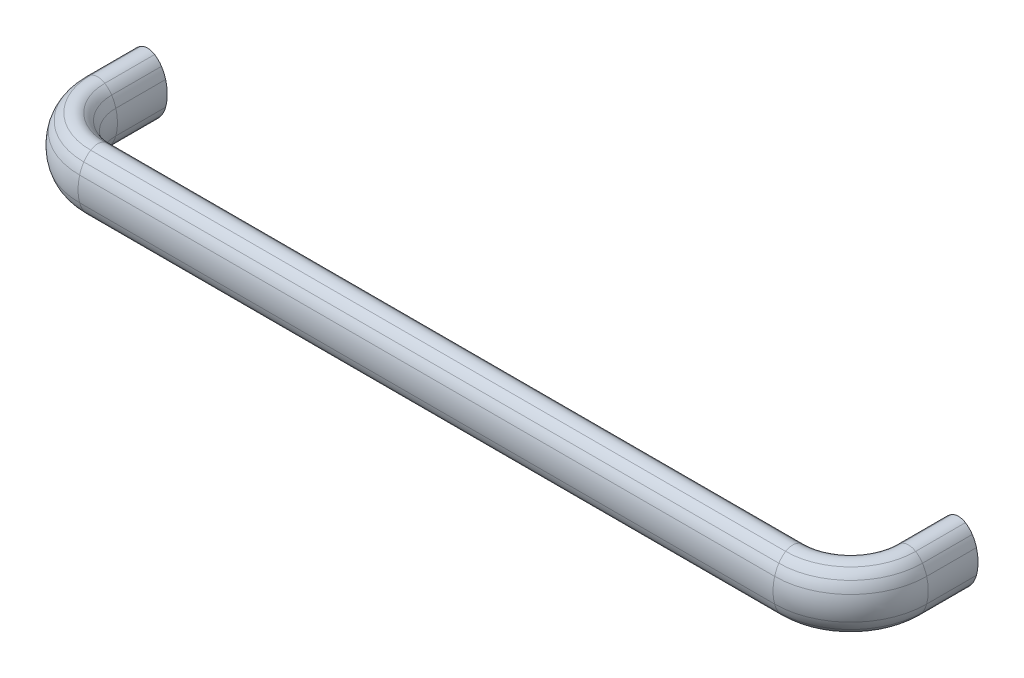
ISO-10303-21;
HEADER;
FILE_DESCRIPTION(('STEP AP214'),'2;1');
FILE_NAME('part.step','',(''),(''),'','','');
FILE_SCHEMA(('AUTOMOTIVE_DESIGN { 1 0 10303 214 1 1 1 1 }'));
ENDSEC;
DATA;
#1=APPLICATION_CONTEXT('core data for automotive mechanical design processes');
#2=APPLICATION_PROTOCOL_DEFINITION('international standard','automotive_design',2000,#1);
#3=PRODUCT_CONTEXT('',#1,'mechanical');
#4=PRODUCT('Part','Part','',(#3));
#5=PRODUCT_RELATED_PRODUCT_CATEGORY('part','',(#4));
#6=PRODUCT_DEFINITION_FORMATION('','',#4);
#7=PRODUCT_DEFINITION_CONTEXT('part definition',#1,'design');
#8=PRODUCT_DEFINITION('design','',#6,#7);
#9=PRODUCT_DEFINITION_SHAPE('','',#8);
#10=(LENGTH_UNIT() NAMED_UNIT(*) SI_UNIT(.MILLI.,.METRE.));
#11=(NAMED_UNIT(*) PLANE_ANGLE_UNIT() SI_UNIT($,.RADIAN.));
#12=(NAMED_UNIT(*) SI_UNIT($,.STERADIAN.) SOLID_ANGLE_UNIT());
#13=UNCERTAINTY_MEASURE_WITH_UNIT(LENGTH_MEASURE(1.E-05),#10,'distance_accuracy_value','');
#14=(GEOMETRIC_REPRESENTATION_CONTEXT(3) GLOBAL_UNCERTAINTY_ASSIGNED_CONTEXT((#13)) GLOBAL_UNIT_ASSIGNED_CONTEXT((#10,
#11,#12)) REPRESENTATION_CONTEXT('',''));
#15=CARTESIAN_POINT('',(0.,0.,0.));
#16=DIRECTION('',(0.,0.,1.));
#17=DIRECTION('',(1.,0.,0.));
#18=AXIS2_PLACEMENT_3D('',#15,#16,#17);
#19=CARTESIAN_POINT('',(351.108318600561,-5.5628443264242,0.));
#20=DIRECTION('',(0.,0.,-1.));
#21=DIRECTION('',(0.,-1.,0.));
#22=AXIS2_PLACEMENT_3D('',#19,#20,#21);
#23=PLANE('',#22);
#24=CARTESIAN_POINT('',(349.999387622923,-7.31331876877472,0.));
#25=DIRECTION('',(0.,0.,-1.));
#26=DIRECTION('',(0.,-1.,0.));
#27=AXIS2_PLACEMENT_3D('',#24,#25,#26);
#28=CIRCLE('',#27,5.68668538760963);
#29=CARTESIAN_POINT('',(353.042642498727,-12.1171703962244,0.));
#30=VERTEX_POINT('',#29);
#31=CARTESIAN_POINT('',(346.95613274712,-12.1171703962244,0.));
#32=VERTEX_POINT('',#31);
#33=EDGE_CURVE('E540',#30,#32,#28,.T.);
#34=ORIENTED_EDGE('',*,*,#33,.T.);
#35=CARTESIAN_POINT('',(352.217249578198,-3.81236988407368,0.));
#36=DIRECTION('',(0.,0.,-1.));
#37=DIRECTION('',(0.,-1.,0.));
#38=AXIS2_PLACEMENT_3D('',#35,#36,#37);
#39=CIRCLE('',#38,9.83102547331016);
#40=CARTESIAN_POINT('',(343.988979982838,-9.19239231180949,0.));
#41=VERTEX_POINT('',#40);
#42=EDGE_CURVE('E18',#32,#41,#39,.T.);
#43=ORIENTED_EDGE('',*,*,#42,.T.);
#44=CARTESIAN_POINT('',(355.739270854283,-1.50950981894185,0.));
#45=DIRECTION('',(0.,0.,-1.));
#46=DIRECTION('',(0.,-1.,0.));
#47=AXIS2_PLACEMENT_3D('',#44,#45,#46);
#48=CIRCLE('',#47,14.0390889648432);
#49=CARTESIAN_POINT('',(342.188367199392,-5.17952740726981,0.));
#50=VERTEX_POINT('',#49);
#51=EDGE_CURVE('E38',#41,#50,#48,.T.);
#52=ORIENTED_EDGE('',*,*,#51,.T.);
#53=CARTESIAN_POINT('',(361.312858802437,-4.15638432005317E-06,0.));
#54=DIRECTION('',(0.,0.,-1.));
#55=DIRECTION('',(0.,-1.,0.));
#56=AXIS2_PLACEMENT_3D('',#53,#54,#55);
#57=CIRCLE('',#56,19.8134711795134);
#58=CARTESIAN_POINT('',(342.188367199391,5.17951909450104,0.));
#59=VERTEX_POINT('',#58);
#60=EDGE_CURVE('E623',#50,#59,#57,.T.);
#61=ORIENTED_EDGE('',*,*,#60,.T.);
#62=CARTESIAN_POINT('',(355.739270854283,1.50950150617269,0.));
#63=DIRECTION('',(0.,0.,-1.));
#64=DIRECTION('',(0.,-1.,0.));
#65=AXIS2_PLACEMENT_3D('',#62,#63,#64);
#66=CIRCLE('',#65,14.0390889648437);
#67=CARTESIAN_POINT('',(343.988979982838,9.19238399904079,0.));
#68=VERTEX_POINT('',#67);
#69=EDGE_CURVE('E620',#59,#68,#66,.T.);
#70=ORIENTED_EDGE('',*,*,#69,.T.);
#71=CARTESIAN_POINT('',(352.217249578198,3.81236157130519,0.));
#72=DIRECTION('',(0.,0.,-1.));
#73=DIRECTION('',(0.,-1.,0.));
#74=AXIS2_PLACEMENT_3D('',#71,#72,#73);
#75=CIRCLE('',#74,9.83102547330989);
#76=CARTESIAN_POINT('',(346.95613274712,12.1171620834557,0.));
#77=VERTEX_POINT('',#76);
#78=EDGE_CURVE('E617',#68,#77,#75,.T.);
#79=ORIENTED_EDGE('',*,*,#78,.T.);
#80=CARTESIAN_POINT('',(349.999387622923,7.31331045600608,0.));
#81=DIRECTION('',(0.,0.,1.));
#82=DIRECTION('',(0.,1.,0.));
#83=AXIS2_PLACEMENT_3D('',#80,#81,#82);
#84=CIRCLE('',#83,5.68668538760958);
#85=CARTESIAN_POINT('',(353.042642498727,12.1171620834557,0.));
#86=VERTEX_POINT('',#85);
#87=EDGE_CURVE('E615',#86,#77,#84,.T.);
#88=ORIENTED_EDGE('',*,*,#87,.F.);
#89=CARTESIAN_POINT('',(347.781525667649,3.81236157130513,0.));
#90=DIRECTION('',(0.,0.,1.));
#91=DIRECTION('',(0.,1.,0.));
#92=AXIS2_PLACEMENT_3D('',#89,#90,#91);
#93=CIRCLE('',#92,9.83102547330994);
#94=CARTESIAN_POINT('',(356.009795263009,9.19238399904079,0.));
#95=VERTEX_POINT('',#94);
#96=EDGE_CURVE('E613',#95,#86,#93,.T.);
#97=ORIENTED_EDGE('',*,*,#96,.F.);
#98=CARTESIAN_POINT('',(344.259504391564,1.50950150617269,0.));
#99=DIRECTION('',(0.,0.,1.));
#100=DIRECTION('',(0.,1.,0.));
#101=AXIS2_PLACEMENT_3D('',#98,#99,#100);
#102=CIRCLE('',#101,14.0390889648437);
#103=CARTESIAN_POINT('',(357.810408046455,5.17951909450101,0.));
#104=VERTEX_POINT('',#103);
#105=EDGE_CURVE('E611',#104,#95,#102,.T.);
#106=ORIENTED_EDGE('',*,*,#105,.F.);
#107=CARTESIAN_POINT('',(338.68591644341,-4.1563845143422E-06,0.));
#108=DIRECTION('',(0.,0.,1.));
#109=DIRECTION('',(0.,1.,0.));
#110=AXIS2_PLACEMENT_3D('',#107,#108,#109);
#111=CIRCLE('',#110,19.8134711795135);
#112=CARTESIAN_POINT('',(357.810408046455,-5.17952740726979,0.));
#113=VERTEX_POINT('',#112);
#114=EDGE_CURVE('E609',#113,#104,#111,.T.);
#115=ORIENTED_EDGE('',*,*,#114,.F.);
#116=CARTESIAN_POINT('',(344.259504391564,-1.50950981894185,0.));
#117=DIRECTION('',(0.,0.,1.));
#118=DIRECTION('',(0.,1.,0.));
#119=AXIS2_PLACEMENT_3D('',#116,#117,#118);
#120=CIRCLE('',#119,14.0390889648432);
#121=CARTESIAN_POINT('',(356.009795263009,-9.19239231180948,0.));
#122=VERTEX_POINT('',#121);
#123=EDGE_CURVE('E607',#122,#113,#120,.T.);
#124=ORIENTED_EDGE('',*,*,#123,.F.);
#125=CARTESIAN_POINT('',(347.781525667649,-3.81236988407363,0.));
#126=DIRECTION('',(0.,0.,1.));
#127=DIRECTION('',(0.,1.,0.));
#128=AXIS2_PLACEMENT_3D('',#125,#126,#127);
#129=CIRCLE('',#128,9.83102547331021);
#130=EDGE_CURVE('E605',#30,#122,#129,.T.);
#131=ORIENTED_EDGE('',*,*,#130,.F.);
#132=EDGE_LOOP('',(#34,#43,#52,#61,#70,#79,#88,#97,#106,#115,#124,#131));
#133=FACE_BOUND('',#132,.T.);
#134=CARTESIAN_POINT('',(350.,0.,0.));
#135=DIRECTION('',(0.,0.,1.));
#136=DIRECTION('',(0.,1.,0.));
#137=AXIS2_PLACEMENT_3D('',#134,#135,#136);
#138=CIRCLE('',#137,4.52350000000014);
#139=CARTESIAN_POINT('',(350.,4.52350000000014,0.));
#140=VERTEX_POINT('',#139);
#141=EDGE_CURVE('E1387',#140,#140,#138,.T.);
#142=ORIENTED_EDGE('',*,*,#141,.T.);
#143=EDGE_LOOP('',(#142));
#144=FACE_BOUND('',#143,.T.);
#145=ADVANCED_FACE('F14',(#133,#144),#23,.T.);
#146=CARTESIAN_POINT('',(-1.10831860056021,-5.5628443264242,0.));
#147=DIRECTION('',(0.,0.,1.));
#148=DIRECTION('',(0.,-1.,0.));
#149=AXIS2_PLACEMENT_3D('',#146,#147,#148);
#150=PLANE('',#149);
#151=CARTESIAN_POINT('',(0.000612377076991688,-7.31331876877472,0.));
#152=DIRECTION('',(0.,0.,1.));
#153=DIRECTION('',(0.,-1.,0.));
#154=AXIS2_PLACEMENT_3D('',#151,#152,#153);
#155=CIRCLE('',#154,5.68668538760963);
#156=CARTESIAN_POINT('',(-3.04264249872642,-12.1171703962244,0.));
#157=VERTEX_POINT('',#156);
#158=CARTESIAN_POINT('',(3.04386725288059,-12.1171703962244,0.));
#159=VERTEX_POINT('',#158);
#160=EDGE_CURVE('E264',#157,#159,#155,.T.);
#161=ORIENTED_EDGE('',*,*,#160,.F.);
#162=CARTESIAN_POINT('',(2.21847433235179,-3.81236988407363,0.));
#163=DIRECTION('',(0.,0.,-1.));
#164=DIRECTION('',(0.,1.,0.));
#165=AXIS2_PLACEMENT_3D('',#162,#163,#164);
#166=CIRCLE('',#165,9.83102547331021);
#167=CARTESIAN_POINT('',(-6.00979526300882,-9.19239231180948,0.));
#168=VERTEX_POINT('',#167);
#169=EDGE_CURVE('E305',#157,#168,#166,.T.);
#170=ORIENTED_EDGE('',*,*,#169,.T.);
#171=CARTESIAN_POINT('',(5.74049560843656,-1.50950981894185,0.));
#172=DIRECTION('',(0.,0.,-1.));
#173=DIRECTION('',(0.,1.,0.));
#174=AXIS2_PLACEMENT_3D('',#171,#172,#173);
#175=CIRCLE('',#174,14.0390889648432);
#176=CARTESIAN_POINT('',(-7.81040804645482,-5.17952740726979,0.));
#177=VERTEX_POINT('',#176);
#178=EDGE_CURVE('E302',#168,#177,#175,.T.);
#179=ORIENTED_EDGE('',*,*,#178,.T.);
#180=CARTESIAN_POINT('',(11.3140835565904,-4.1563845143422E-06,0.));
#181=DIRECTION('',(0.,0.,-1.));
#182=DIRECTION('',(0.,1.,0.));
#183=AXIS2_PLACEMENT_3D('',#180,#181,#182);
#184=CIRCLE('',#183,19.8134711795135);
#185=CARTESIAN_POINT('',(-7.81040804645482,5.17951909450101,0.));
#186=VERTEX_POINT('',#185);
#187=EDGE_CURVE('E299',#177,#186,#184,.T.);
#188=ORIENTED_EDGE('',*,*,#187,.T.);
#189=CARTESIAN_POINT('',(5.74049560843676,1.50950150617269,0.));
#190=DIRECTION('',(0.,0.,-1.));
#191=DIRECTION('',(0.,1.,0.));
#192=AXIS2_PLACEMENT_3D('',#189,#190,#191);
#193=CIRCLE('',#192,14.0390889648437);
#194=CARTESIAN_POINT('',(-6.00979526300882,9.19238399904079,0.));
#195=VERTEX_POINT('',#194);
#196=EDGE_CURVE('E296',#186,#195,#193,.T.);
#197=ORIENTED_EDGE('',*,*,#196,.T.);
#198=CARTESIAN_POINT('',(2.21847433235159,3.81236157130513,0.));
#199=DIRECTION('',(0.,0.,-1.));
#200=DIRECTION('',(0.,1.,0.));
#201=AXIS2_PLACEMENT_3D('',#198,#199,#200);
#202=CIRCLE('',#201,9.83102547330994);
#203=CARTESIAN_POINT('',(-3.04264249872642,12.1171620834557,0.));
#204=VERTEX_POINT('',#203);
#205=EDGE_CURVE('E293',#195,#204,#202,.T.);
#206=ORIENTED_EDGE('',*,*,#205,.T.);
#207=CARTESIAN_POINT('',(0.000612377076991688,7.31331045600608,0.));
#208=DIRECTION('',(0.,0.,1.));
#209=DIRECTION('',(0.,-1.,0.));
#210=AXIS2_PLACEMENT_3D('',#207,#208,#209);
#211=CIRCLE('',#210,5.68668538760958);
#212=CARTESIAN_POINT('',(3.04386725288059,12.1171620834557,0.));
#213=VERTEX_POINT('',#212);
#214=EDGE_CURVE('E291',#213,#204,#211,.T.);
#215=ORIENTED_EDGE('',*,*,#214,.F.);
#216=CARTESIAN_POINT('',(-2.21724957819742,3.81236157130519,0.));
#217=DIRECTION('',(0.,0.,1.));
#218=DIRECTION('',(0.,-1.,0.));
#219=AXIS2_PLACEMENT_3D('',#216,#217,#218);
#220=CIRCLE('',#219,9.83102547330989);
#221=CARTESIAN_POINT('',(6.01102001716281,9.19238399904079,0.));
#222=VERTEX_POINT('',#221);
#223=EDGE_CURVE('E288',#222,#213,#220,.T.);
#224=ORIENTED_EDGE('',*,*,#223,.F.);
#225=CARTESIAN_POINT('',(-5.73927085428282,1.50950150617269,0.));
#226=DIRECTION('',(0.,0.,1.));
#227=DIRECTION('',(0.,-1.,0.));
#228=AXIS2_PLACEMENT_3D('',#225,#226,#227);
#229=CIRCLE('',#228,14.0390889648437);
#230=CARTESIAN_POINT('',(7.81163280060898,5.17951909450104,0.));
#231=VERTEX_POINT('',#230);
#232=EDGE_CURVE('E285',#231,#222,#229,.T.);
#233=ORIENTED_EDGE('',*,*,#232,.F.);
#234=CARTESIAN_POINT('',(-11.3128588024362,-4.15638432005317E-06,0.));
#235=DIRECTION('',(0.,0.,1.));
#236=DIRECTION('',(0.,-1.,0.));
#237=AXIS2_PLACEMENT_3D('',#234,#235,#236);
#238=CIRCLE('',#237,19.8134711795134);
#239=CARTESIAN_POINT('',(7.81163280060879,-5.17952740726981,0.));
#240=VERTEX_POINT('',#239);
#241=EDGE_CURVE('E279',#240,#231,#238,.T.);
#242=ORIENTED_EDGE('',*,*,#241,.F.);
#243=CARTESIAN_POINT('',(-5.73927085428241,-1.50950981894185,0.));
#244=DIRECTION('',(0.,0.,1.));
#245=DIRECTION('',(0.,-1.,0.));
#246=AXIS2_PLACEMENT_3D('',#243,#244,#245);
#247=CIRCLE('',#246,14.0390889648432);
#248=CARTESIAN_POINT('',(6.01102001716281,-9.19239231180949,0.));
#249=VERTEX_POINT('',#248);
#250=EDGE_CURVE('E277',#249,#240,#247,.T.);
#251=ORIENTED_EDGE('',*,*,#250,.F.);
#252=CARTESIAN_POINT('',(-2.21724957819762,-3.81236988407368,0.));
#253=DIRECTION('',(0.,0.,1.));
#254=DIRECTION('',(0.,-1.,0.));
#255=AXIS2_PLACEMENT_3D('',#252,#253,#254);
#256=CIRCLE('',#255,9.83102547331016);
#257=EDGE_CURVE('E255',#159,#249,#256,.T.);
#258=ORIENTED_EDGE('',*,*,#257,.F.);
#259=EDGE_LOOP('',(#161,#170,#179,#188,#197,#206,#215,#224,#233,#242,#251,#258));
#260=FACE_BOUND('',#259,.T.);
#261=CARTESIAN_POINT('',(0.,0.,0.));
#262=DIRECTION('',(0.,0.,-1.));
#263=DIRECTION('',(0.,1.,0.));
#264=AXIS2_PLACEMENT_3D('',#261,#262,#263);
#265=CIRCLE('',#264,4.52350000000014);
#266=CARTESIAN_POINT('',(0.,4.52350000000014,0.));
#267=VERTEX_POINT('',#266);
#268=EDGE_CURVE('E271',#267,#267,#265,.T.);
#269=ORIENTED_EDGE('',*,*,#268,.F.);
#270=EDGE_LOOP('',(#269));
#271=FACE_BOUND('',#270,.T.);
#272=ADVANCED_FACE('F273',(#260,#271),#150,.F.);
#273=CARTESIAN_POINT('',(352.217249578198,-3.81236988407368,21.5));
#274=DIRECTION('',(0.,0.,-1.));
#275=DIRECTION('',(0.,1.,0.));
#276=AXIS2_PLACEMENT_3D('',#273,#274,#275);
#277=CYLINDRICAL_SURFACE('',#276,9.83102547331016);
#278=CARTESIAN_POINT('',(352.217249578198,-3.81236988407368,21.5));
#279=DIRECTION('',(0.,0.,-1.));
#280=DIRECTION('',(0.,-1.,0.));
#281=AXIS2_PLACEMENT_3D('',#278,#279,#280);
#282=CIRCLE('',#281,9.83102547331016);
#283=CARTESIAN_POINT('',(346.95613274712,-12.1171703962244,21.5));
#284=VERTEX_POINT('',#283);
#285=CARTESIAN_POINT('',(343.988979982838,-9.19239231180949,21.5));
#286=VERTEX_POINT('',#285);
#287=EDGE_CURVE('E507',#284,#286,#282,.T.);
#288=ORIENTED_EDGE('',*,*,#287,.T.);
#289=DIRECTION('',(0.,0.,-1.));
#290=VECTOR('',#289,1.);
#291=CARTESIAN_POINT('',(343.988979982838,-9.19239231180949,21.5));
#292=LINE('',#291,#290);
#293=EDGE_CURVE('E23',#286,#41,#292,.T.);
#294=ORIENTED_EDGE('',*,*,#293,.T.);
#295=ORIENTED_EDGE('',*,*,#42,.F.);
#296=DIRECTION('',(0.,0.,-1.));
#297=VECTOR('',#296,1.);
#298=CARTESIAN_POINT('',(346.95613274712,-12.1171703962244,21.5));
#299=LINE('',#298,#297);
#300=EDGE_CURVE('E9',#284,#32,#299,.T.);
#301=ORIENTED_EDGE('',*,*,#300,.F.);
#302=EDGE_LOOP('',(#288,#294,#295,#301));
#303=FACE_BOUND('',#302,.T.);
#304=ADVANCED_FACE('F16',(#303),#277,.T.);
#305=CARTESIAN_POINT('',(355.739270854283,-1.50950981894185,21.5));
#306=DIRECTION('',(0.,0.,-1.));
#307=DIRECTION('',(0.,1.,0.));
#308=AXIS2_PLACEMENT_3D('',#305,#306,#307);
#309=CYLINDRICAL_SURFACE('',#308,14.0390889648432);
#310=CARTESIAN_POINT('',(355.739270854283,-1.50950981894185,21.5));
#311=DIRECTION('',(0.,0.,-1.));
#312=DIRECTION('',(0.,-1.,0.));
#313=AXIS2_PLACEMENT_3D('',#310,#311,#312);
#314=CIRCLE('',#313,14.0390889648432);
#315=CARTESIAN_POINT('',(342.188367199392,-5.17952740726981,21.5));
#316=VERTEX_POINT('',#315);
#317=EDGE_CURVE('E569',#286,#316,#314,.T.);
#318=ORIENTED_EDGE('',*,*,#317,.T.);
#319=DIRECTION('',(0.,0.,-1.));
#320=VECTOR('',#319,1.);
#321=CARTESIAN_POINT('',(342.188367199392,-5.17952740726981,21.5));
#322=LINE('',#321,#320);
#323=EDGE_CURVE('E601',#316,#50,#322,.T.);
#324=ORIENTED_EDGE('',*,*,#323,.T.);
#325=ORIENTED_EDGE('',*,*,#51,.F.);
#326=ORIENTED_EDGE('',*,*,#293,.F.);
#327=EDGE_LOOP('',(#318,#324,#325,#326));
#328=FACE_BOUND('',#327,.T.);
#329=ADVANCED_FACE('F630',(#328),#309,.T.);
#330=CARTESIAN_POINT('',(361.312858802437,-4.15638432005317E-06,21.5));
#331=DIRECTION('',(0.,0.,-1.));
#332=DIRECTION('',(0.,1.,0.));
#333=AXIS2_PLACEMENT_3D('',#330,#331,#332);
#334=CYLINDRICAL_SURFACE('',#333,19.8134711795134);
#335=CARTESIAN_POINT('',(361.312858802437,-4.15638432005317E-06,21.5));
#336=DIRECTION('',(0.,0.,-1.));
#337=DIRECTION('',(0.,-1.,0.));
#338=AXIS2_PLACEMENT_3D('',#335,#336,#337);
#339=CIRCLE('',#338,19.8134711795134);
#340=CARTESIAN_POINT('',(342.188367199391,5.17951909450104,21.5));
#341=VERTEX_POINT('',#340);
#342=EDGE_CURVE('E566',#316,#341,#339,.T.);
#343=ORIENTED_EDGE('',*,*,#342,.T.);
#344=DIRECTION('',(0.,0.,-1.));
#345=VECTOR('',#344,1.);
#346=CARTESIAN_POINT('',(342.188367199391,5.17951909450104,21.5));
#347=LINE('',#346,#345);
#348=EDGE_CURVE('E598',#341,#59,#347,.T.);
#349=ORIENTED_EDGE('',*,*,#348,.T.);
#350=ORIENTED_EDGE('',*,*,#60,.F.);
#351=ORIENTED_EDGE('',*,*,#323,.F.);
#352=EDGE_LOOP('',(#343,#349,#350,#351));
#353=FACE_BOUND('',#352,.T.);
#354=ADVANCED_FACE('F685',(#353),#334,.T.);
#355=CARTESIAN_POINT('',(355.739270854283,1.50950150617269,21.5));
#356=DIRECTION('',(0.,0.,-1.));
#357=DIRECTION('',(0.,1.,0.));
#358=AXIS2_PLACEMENT_3D('',#355,#356,#357);
#359=CYLINDRICAL_SURFACE('',#358,14.0390889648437);
#360=CARTESIAN_POINT('',(355.739270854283,1.50950150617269,21.5));
#361=DIRECTION('',(0.,0.,-1.));
#362=DIRECTION('',(0.,-1.,0.));
#363=AXIS2_PLACEMENT_3D('',#360,#361,#362);
#364=CIRCLE('',#363,14.0390889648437);
#365=CARTESIAN_POINT('',(343.988979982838,9.19238399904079,21.5));
#366=VERTEX_POINT('',#365);
#367=EDGE_CURVE('E563',#341,#366,#364,.T.);
#368=ORIENTED_EDGE('',*,*,#367,.T.);
#369=DIRECTION('',(0.,0.,-1.));
#370=VECTOR('',#369,1.);
#371=CARTESIAN_POINT('',(343.988979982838,9.19238399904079,21.5));
#372=LINE('',#371,#370);
#373=EDGE_CURVE('E595',#366,#68,#372,.T.);
#374=ORIENTED_EDGE('',*,*,#373,.T.);
#375=ORIENTED_EDGE('',*,*,#69,.F.);
#376=ORIENTED_EDGE('',*,*,#348,.F.);
#377=EDGE_LOOP('',(#368,#374,#375,#376));
#378=FACE_BOUND('',#377,.T.);
#379=ADVANCED_FACE('F684',(#378),#359,.T.);
#380=CARTESIAN_POINT('',(352.217249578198,3.81236157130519,21.5));
#381=DIRECTION('',(0.,0.,-1.));
#382=DIRECTION('',(0.,1.,0.));
#383=AXIS2_PLACEMENT_3D('',#380,#381,#382);
#384=CYLINDRICAL_SURFACE('',#383,9.83102547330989);
#385=CARTESIAN_POINT('',(352.217249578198,3.81236157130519,21.5));
#386=DIRECTION('',(0.,0.,-1.));
#387=DIRECTION('',(0.,-1.,0.));
#388=AXIS2_PLACEMENT_3D('',#385,#386,#387);
#389=CIRCLE('',#388,9.83102547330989);
#390=CARTESIAN_POINT('',(346.95613274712,12.1171620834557,21.5));
#391=VERTEX_POINT('',#390);
#392=EDGE_CURVE('E560',#366,#391,#389,.T.);
#393=ORIENTED_EDGE('',*,*,#392,.T.);
#394=DIRECTION('',(0.,0.,-1.));
#395=VECTOR('',#394,1.);
#396=CARTESIAN_POINT('',(346.95613274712,12.1171620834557,21.5));
#397=LINE('',#396,#395);
#398=EDGE_CURVE('E592',#391,#77,#397,.T.);
#399=ORIENTED_EDGE('',*,*,#398,.T.);
#400=ORIENTED_EDGE('',*,*,#78,.F.);
#401=ORIENTED_EDGE('',*,*,#373,.F.);
#402=EDGE_LOOP('',(#393,#399,#400,#401));
#403=FACE_BOUND('',#402,.T.);
#404=ADVANCED_FACE('F690',(#403),#384,.T.);
#405=CARTESIAN_POINT('',(349.999387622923,7.31331045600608,21.5));
#406=DIRECTION('',(0.,0.,-1.));
#407=DIRECTION('',(0.,1.,0.));
#408=AXIS2_PLACEMENT_3D('',#405,#406,#407);
#409=CYLINDRICAL_SURFACE('',#408,5.68668538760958);
#410=CARTESIAN_POINT('',(349.999387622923,7.31331045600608,21.5));
#411=DIRECTION('',(0.,0.,1.));
#412=DIRECTION('',(0.,1.,0.));
#413=AXIS2_PLACEMENT_3D('',#410,#411,#412);
#414=CIRCLE('',#413,5.68668538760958);
#415=CARTESIAN_POINT('',(353.042642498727,12.1171620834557,21.5));
#416=VERTEX_POINT('',#415);
#417=EDGE_CURVE('E558',#416,#391,#414,.T.);
#418=ORIENTED_EDGE('',*,*,#417,.F.);
#419=DIRECTION('',(0.,0.,-1.));
#420=VECTOR('',#419,1.);
#421=CARTESIAN_POINT('',(353.042642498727,12.1171620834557,21.5));
#422=LINE('',#421,#420);
#423=EDGE_CURVE('E589',#416,#86,#422,.T.);
#424=ORIENTED_EDGE('',*,*,#423,.T.);
#425=ORIENTED_EDGE('',*,*,#87,.T.);
#426=ORIENTED_EDGE('',*,*,#398,.F.);
#427=EDGE_LOOP('',(#418,#424,#425,#426));
#428=FACE_BOUND('',#427,.T.);
#429=ADVANCED_FACE('F693',(#428),#409,.T.);
#430=CARTESIAN_POINT('',(347.781525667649,3.81236157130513,21.5));
#431=DIRECTION('',(0.,0.,-1.));
#432=DIRECTION('',(0.,1.,0.));
#433=AXIS2_PLACEMENT_3D('',#430,#431,#432);
#434=CYLINDRICAL_SURFACE('',#433,9.83102547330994);
#435=CARTESIAN_POINT('',(347.781525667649,3.81236157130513,21.5));
#436=DIRECTION('',(0.,0.,1.));
#437=DIRECTION('',(0.,1.,0.));
#438=AXIS2_PLACEMENT_3D('',#435,#436,#437);
#439=CIRCLE('',#438,9.83102547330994);
#440=CARTESIAN_POINT('',(356.009795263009,9.19238399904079,21.5));
#441=VERTEX_POINT('',#440);
#442=EDGE_CURVE('E555',#441,#416,#439,.T.);
#443=ORIENTED_EDGE('',*,*,#442,.F.);
#444=DIRECTION('',(0.,0.,-1.));
#445=VECTOR('',#444,1.);
#446=CARTESIAN_POINT('',(356.009795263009,9.19238399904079,21.5));
#447=LINE('',#446,#445);
#448=EDGE_CURVE('E586',#441,#95,#447,.T.);
#449=ORIENTED_EDGE('',*,*,#448,.T.);
#450=ORIENTED_EDGE('',*,*,#96,.T.);
#451=ORIENTED_EDGE('',*,*,#423,.F.);
#452=EDGE_LOOP('',(#443,#449,#450,#451));
#453=FACE_BOUND('',#452,.T.);
#454=ADVANCED_FACE('F696',(#453),#434,.T.);
#455=CARTESIAN_POINT('',(344.259504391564,1.50950150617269,21.5));
#456=DIRECTION('',(0.,0.,-1.));
#457=DIRECTION('',(0.,1.,0.));
#458=AXIS2_PLACEMENT_3D('',#455,#456,#457);
#459=CYLINDRICAL_SURFACE('',#458,14.0390889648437);
#460=CARTESIAN_POINT('',(344.259504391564,1.50950150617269,21.5));
#461=DIRECTION('',(0.,0.,1.));
#462=DIRECTION('',(0.,1.,0.));
#463=AXIS2_PLACEMENT_3D('',#460,#461,#462);
#464=CIRCLE('',#463,14.0390889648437);
#465=CARTESIAN_POINT('',(357.810408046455,5.17951909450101,21.5));
#466=VERTEX_POINT('',#465);
#467=EDGE_CURVE('E552',#466,#441,#464,.T.);
#468=ORIENTED_EDGE('',*,*,#467,.F.);
#469=DIRECTION('',(0.,0.,-1.));
#470=VECTOR('',#469,1.);
#471=CARTESIAN_POINT('',(357.810408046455,5.17951909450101,21.5));
#472=LINE('',#471,#470);
#473=EDGE_CURVE('E583',#466,#104,#472,.T.);
#474=ORIENTED_EDGE('',*,*,#473,.T.);
#475=ORIENTED_EDGE('',*,*,#105,.T.);
#476=ORIENTED_EDGE('',*,*,#448,.F.);
#477=EDGE_LOOP('',(#468,#474,#475,#476));
#478=FACE_BOUND('',#477,.T.);
#479=ADVANCED_FACE('F702',(#478),#459,.T.);
#480=CARTESIAN_POINT('',(338.68591644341,-4.1563845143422E-06,21.5));
#481=DIRECTION('',(0.,0.,-1.));
#482=DIRECTION('',(0.,1.,0.));
#483=AXIS2_PLACEMENT_3D('',#480,#481,#482);
#484=CYLINDRICAL_SURFACE('',#483,19.8134711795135);
#485=CARTESIAN_POINT('',(338.68591644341,-4.1563845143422E-06,21.5));
#486=DIRECTION('',(0.,0.,1.));
#487=DIRECTION('',(0.,1.,0.));
#488=AXIS2_PLACEMENT_3D('',#485,#486,#487);
#489=CIRCLE('',#488,19.8134711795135);
#490=CARTESIAN_POINT('',(357.810408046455,-5.17952740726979,21.5));
#491=VERTEX_POINT('',#490);
#492=EDGE_CURVE('E549',#491,#466,#489,.T.);
#493=ORIENTED_EDGE('',*,*,#492,.F.);
#494=DIRECTION('',(0.,0.,-1.));
#495=VECTOR('',#494,1.);
#496=CARTESIAN_POINT('',(357.810408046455,-5.17952740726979,21.5));
#497=LINE('',#496,#495);
#498=EDGE_CURVE('E580',#491,#113,#497,.T.);
#499=ORIENTED_EDGE('',*,*,#498,.T.);
#500=ORIENTED_EDGE('',*,*,#114,.T.);
#501=ORIENTED_EDGE('',*,*,#473,.F.);
#502=EDGE_LOOP('',(#493,#499,#500,#501));
#503=FACE_BOUND('',#502,.T.);
#504=ADVANCED_FACE('F705',(#503),#484,.T.);
#505=CARTESIAN_POINT('',(344.259504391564,-1.50950981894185,21.5));
#506=DIRECTION('',(0.,0.,-1.));
#507=DIRECTION('',(0.,1.,0.));
#508=AXIS2_PLACEMENT_3D('',#505,#506,#507);
#509=CYLINDRICAL_SURFACE('',#508,14.0390889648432);
#510=CARTESIAN_POINT('',(344.259504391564,-1.50950981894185,21.5));
#511=DIRECTION('',(0.,0.,1.));
#512=DIRECTION('',(0.,1.,0.));
#513=AXIS2_PLACEMENT_3D('',#510,#511,#512);
#514=CIRCLE('',#513,14.0390889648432);
#515=CARTESIAN_POINT('',(356.009795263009,-9.19239231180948,21.5));
#516=VERTEX_POINT('',#515);
#517=EDGE_CURVE('E546',#516,#491,#514,.T.);
#518=ORIENTED_EDGE('',*,*,#517,.F.);
#519=DIRECTION('',(0.,0.,-1.));
#520=VECTOR('',#519,1.);
#521=CARTESIAN_POINT('',(356.009795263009,-9.19239231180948,21.5));
#522=LINE('',#521,#520);
#523=EDGE_CURVE('E577',#516,#122,#522,.T.);
#524=ORIENTED_EDGE('',*,*,#523,.T.);
#525=ORIENTED_EDGE('',*,*,#123,.T.);
#526=ORIENTED_EDGE('',*,*,#498,.F.);
#527=EDGE_LOOP('',(#518,#524,#525,#526));
#528=FACE_BOUND('',#527,.T.);
#529=ADVANCED_FACE('F708',(#528),#509,.T.);
#530=CARTESIAN_POINT('',(347.781525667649,-3.81236988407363,21.5));
#531=DIRECTION('',(0.,0.,-1.));
#532=DIRECTION('',(0.,1.,0.));
#533=AXIS2_PLACEMENT_3D('',#530,#531,#532);
#534=CYLINDRICAL_SURFACE('',#533,9.83102547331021);
#535=CARTESIAN_POINT('',(347.781525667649,-3.81236988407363,21.5));
#536=DIRECTION('',(0.,0.,1.));
#537=DIRECTION('',(0.,1.,0.));
#538=AXIS2_PLACEMENT_3D('',#535,#536,#537);
#539=CIRCLE('',#538,9.83102547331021);
#540=CARTESIAN_POINT('',(353.042642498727,-12.1171703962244,21.5));
#541=VERTEX_POINT('',#540);
#542=EDGE_CURVE('E543',#541,#516,#539,.T.);
#543=ORIENTED_EDGE('',*,*,#542,.F.);
#544=DIRECTION('',(0.,0.,-1.));
#545=VECTOR('',#544,1.);
#546=CARTESIAN_POINT('',(353.042642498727,-12.1171703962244,21.5));
#547=LINE('',#546,#545);
#548=EDGE_CURVE('E574',#541,#30,#547,.T.);
#549=ORIENTED_EDGE('',*,*,#548,.T.);
#550=ORIENTED_EDGE('',*,*,#130,.T.);
#551=ORIENTED_EDGE('',*,*,#523,.F.);
#552=EDGE_LOOP('',(#543,#549,#550,#551));
#553=FACE_BOUND('',#552,.T.);
#554=ADVANCED_FACE('F712',(#553),#534,.T.);
#555=CARTESIAN_POINT('',(349.999387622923,-7.31331876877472,21.5));
#556=DIRECTION('',(0.,0.,-1.));
#557=DIRECTION('',(0.,1.,0.));
#558=AXIS2_PLACEMENT_3D('',#555,#556,#557);
#559=CYLINDRICAL_SURFACE('',#558,5.68668538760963);
#560=CARTESIAN_POINT('',(349.999387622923,-7.31331876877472,21.5));
#561=DIRECTION('',(0.,0.,-1.));
#562=DIRECTION('',(0.,-1.,0.));
#563=AXIS2_PLACEMENT_3D('',#560,#561,#562);
#564=CIRCLE('',#563,5.68668538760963);
#565=EDGE_CURVE('E469',#541,#284,#564,.T.);
#566=ORIENTED_EDGE('',*,*,#565,.T.);
#567=ORIENTED_EDGE('',*,*,#300,.T.);
#568=ORIENTED_EDGE('',*,*,#33,.F.);
#569=ORIENTED_EDGE('',*,*,#548,.F.);
#570=EDGE_LOOP('',(#566,#567,#568,#569));
#571=FACE_BOUND('',#570,.T.);
#572=ADVANCED_FACE('F714',(#571),#559,.T.);
#573=CARTESIAN_POINT('',(325.,-3.81236988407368,21.5));
#574=DIRECTION('',(0.,1.,0.));
#575=DIRECTION('',(-1.,0.,0.));
#576=AXIS2_PLACEMENT_3D('',#573,#574,#575);
#577=TOROIDAL_SURFACE('',#576,27.2172495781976,9.83102547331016);
#578=CARTESIAN_POINT('',(325.,-3.81236988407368,48.7172495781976));
#579=DIRECTION('',(1.,0.,0.));
#580=DIRECTION('',(0.,-1.,0.));
#581=AXIS2_PLACEMENT_3D('',#578,#579,#580);
#582=CIRCLE('',#581,9.83102547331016);
#583=CARTESIAN_POINT('',(325.,-12.1171703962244,43.4561327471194));
#584=VERTEX_POINT('',#583);
#585=CARTESIAN_POINT('',(325.,-9.19239231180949,40.4889799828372));
#586=VERTEX_POINT('',#585);
#587=EDGE_CURVE('E436',#584,#586,#582,.T.);
#588=ORIENTED_EDGE('',*,*,#587,.T.);
#589=CARTESIAN_POINT('',(325.,-9.19239231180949,21.5));
#590=DIRECTION('',(0.,1.,0.));
#591=DIRECTION('',(-1.,0.,0.));
#592=AXIS2_PLACEMENT_3D('',#589,#590,#591);
#593=CIRCLE('',#592,18.9889799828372);
#594=EDGE_CURVE('E534',#586,#286,#593,.T.);
#595=ORIENTED_EDGE('',*,*,#594,.T.);
#596=ORIENTED_EDGE('',*,*,#287,.F.);
#597=CARTESIAN_POINT('',(325.,-12.1171703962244,21.5));
#598=DIRECTION('',(0.,1.,0.));
#599=DIRECTION('',(-1.,0.,0.));
#600=AXIS2_PLACEMENT_3D('',#597,#598,#599);
#601=CIRCLE('',#600,21.9561327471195);
#602=EDGE_CURVE('E537',#584,#284,#601,.T.);
#603=ORIENTED_EDGE('',*,*,#602,.F.);
#604=EDGE_LOOP('',(#588,#595,#596,#603));
#605=FACE_BOUND('',#604,.T.);
#606=ADVANCED_FACE('F718',(#605),#577,.T.);
#607=CARTESIAN_POINT('',(325.,-1.50950981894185,21.5));
#608=DIRECTION('',(0.,1.,0.));
#609=DIRECTION('',(-1.,0.,0.));
#610=AXIS2_PLACEMENT_3D('',#607,#608,#609);
#611=TOROIDAL_SURFACE('',#610,30.7392708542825,14.0390889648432);
#612=CARTESIAN_POINT('',(325.,-1.50950981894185,52.2392708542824));
#613=DIRECTION('',(1.,0.,0.));
#614=DIRECTION('',(0.,-1.,0.));
#615=AXIS2_PLACEMENT_3D('',#612,#613,#614);
#616=CIRCLE('',#615,14.0390889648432);
#617=CARTESIAN_POINT('',(325.,-5.17952740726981,38.6883671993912));
#618=VERTEX_POINT('',#617);
#619=EDGE_CURVE('E498',#586,#618,#616,.T.);
#620=ORIENTED_EDGE('',*,*,#619,.T.);
#621=CARTESIAN_POINT('',(325.,-5.17952740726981,21.5));
#622=DIRECTION('',(0.,1.,0.));
#623=DIRECTION('',(-1.,0.,0.));
#624=AXIS2_PLACEMENT_3D('',#621,#622,#623);
#625=CIRCLE('',#624,17.1883671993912);
#626=EDGE_CURVE('E531',#618,#316,#625,.T.);
#627=ORIENTED_EDGE('',*,*,#626,.T.);
#628=ORIENTED_EDGE('',*,*,#317,.F.);
#629=ORIENTED_EDGE('',*,*,#594,.F.);
#630=EDGE_LOOP('',(#620,#627,#628,#629));
#631=FACE_BOUND('',#630,.T.);
#632=ADVANCED_FACE('F637',(#631),#611,.T.);
#633=CARTESIAN_POINT('',(325.,-4.15638432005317E-06,21.5));
#634=DIRECTION('',(0.,1.,0.));
#635=DIRECTION('',(-1.,0.,0.));
#636=AXIS2_PLACEMENT_3D('',#633,#634,#635);
#637=TOROIDAL_SURFACE('',#636,36.3128588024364,19.8134711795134);
#638=CARTESIAN_POINT('',(325.,-4.15638432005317E-06,57.8128588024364));
#639=DIRECTION('',(1.,0.,0.));
#640=DIRECTION('',(0.,-1.,0.));
#641=AXIS2_PLACEMENT_3D('',#638,#639,#640);
#642=CIRCLE('',#641,19.8134711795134);
#643=CARTESIAN_POINT('',(325.,5.17951909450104,38.6883671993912));
#644=VERTEX_POINT('',#643);
#645=EDGE_CURVE('E495',#618,#644,#642,.T.);
#646=ORIENTED_EDGE('',*,*,#645,.T.);
#647=CARTESIAN_POINT('',(325.,5.17951909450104,21.5));
#648=DIRECTION('',(0.,1.,0.));
#649=DIRECTION('',(-1.,0.,0.));
#650=AXIS2_PLACEMENT_3D('',#647,#648,#649);
#651=CIRCLE('',#650,17.1883671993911);
#652=EDGE_CURVE('E528',#644,#341,#651,.T.);
#653=ORIENTED_EDGE('',*,*,#652,.T.);
#654=ORIENTED_EDGE('',*,*,#342,.F.);
#655=ORIENTED_EDGE('',*,*,#626,.F.);
#656=EDGE_LOOP('',(#646,#653,#654,#655));
#657=FACE_BOUND('',#656,.T.);
#658=ADVANCED_FACE('F634',(#657),#637,.T.);
#659=CARTESIAN_POINT('',(325.,1.50950150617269,21.5));
#660=DIRECTION('',(0.,1.,0.));
#661=DIRECTION('',(-1.,0.,0.));
#662=AXIS2_PLACEMENT_3D('',#659,#660,#661);
#663=TOROIDAL_SURFACE('',#662,30.7392708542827,14.0390889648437);
#664=CARTESIAN_POINT('',(325.,1.50950150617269,52.2392708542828));
#665=DIRECTION('',(1.,0.,0.));
#666=DIRECTION('',(0.,-1.,0.));
#667=AXIS2_PLACEMENT_3D('',#664,#665,#666);
#668=CIRCLE('',#667,14.0390889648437);
#669=CARTESIAN_POINT('',(325.,9.19238399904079,40.4889799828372));
#670=VERTEX_POINT('',#669);
#671=EDGE_CURVE('E492',#644,#670,#668,.T.);
#672=ORIENTED_EDGE('',*,*,#671,.T.);
#673=CARTESIAN_POINT('',(325.,9.19238399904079,21.5));
#674=DIRECTION('',(0.,1.,0.));
#675=DIRECTION('',(-1.,0.,0.));
#676=AXIS2_PLACEMENT_3D('',#673,#674,#675);
#677=CIRCLE('',#676,18.9889799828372);
#678=EDGE_CURVE('E525',#670,#366,#677,.T.);
#679=ORIENTED_EDGE('',*,*,#678,.T.);
#680=ORIENTED_EDGE('',*,*,#367,.F.);
#681=ORIENTED_EDGE('',*,*,#652,.F.);
#682=EDGE_LOOP('',(#672,#679,#680,#681));
#683=FACE_BOUND('',#682,.T.);
#684=ADVANCED_FACE('F682',(#683),#663,.T.);
#685=CARTESIAN_POINT('',(325.,3.81236157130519,21.5));
#686=DIRECTION('',(0.,1.,0.));
#687=DIRECTION('',(-1.,0.,0.));
#688=AXIS2_PLACEMENT_3D('',#685,#686,#687);
#689=TOROIDAL_SURFACE('',#688,27.2172495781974,9.83102547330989);
#690=CARTESIAN_POINT('',(325.,3.81236157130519,48.7172495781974));
#691=DIRECTION('',(1.,0.,0.));
#692=DIRECTION('',(0.,-1.,0.));
#693=AXIS2_PLACEMENT_3D('',#690,#691,#692);
#694=CIRCLE('',#693,9.83102547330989);
#695=CARTESIAN_POINT('',(325.,12.1171620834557,43.4561327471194));
#696=VERTEX_POINT('',#695);
#697=EDGE_CURVE('E489',#670,#696,#694,.T.);
#698=ORIENTED_EDGE('',*,*,#697,.T.);
#699=CARTESIAN_POINT('',(325.,12.1171620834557,21.5));
#700=DIRECTION('',(0.,1.,0.));
#701=DIRECTION('',(-1.,0.,0.));
#702=AXIS2_PLACEMENT_3D('',#699,#700,#701);
#703=CIRCLE('',#702,21.9561327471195);
#704=EDGE_CURVE('E522',#696,#391,#703,.T.);
#705=ORIENTED_EDGE('',*,*,#704,.T.);
#706=ORIENTED_EDGE('',*,*,#392,.F.);
#707=ORIENTED_EDGE('',*,*,#678,.F.);
#708=EDGE_LOOP('',(#698,#705,#706,#707));
#709=FACE_BOUND('',#708,.T.);
#710=ADVANCED_FACE('F678',(#709),#689,.T.);
#711=CARTESIAN_POINT('',(325.,7.31331045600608,21.5));
#712=DIRECTION('',(0.,1.,0.));
#713=DIRECTION('',(-1.,0.,0.));
#714=AXIS2_PLACEMENT_3D('',#711,#712,#713);
#715=TOROIDAL_SURFACE('',#714,24.999387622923,5.68668538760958);
#716=CARTESIAN_POINT('',(325.,7.31331045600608,46.499387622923));
#717=DIRECTION('',(-1.,0.,0.));
#718=DIRECTION('',(0.,1.,0.));
#719=AXIS2_PLACEMENT_3D('',#716,#717,#718);
#720=CIRCLE('',#719,5.68668538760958);
#721=CARTESIAN_POINT('',(325.,12.1171620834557,49.5426424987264));
#722=VERTEX_POINT('',#721);
#723=EDGE_CURVE('E487',#722,#696,#720,.T.);
#724=ORIENTED_EDGE('',*,*,#723,.F.);
#725=CARTESIAN_POINT('',(325.,12.1171620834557,21.5));
#726=DIRECTION('',(0.,1.,0.));
#727=DIRECTION('',(-1.,0.,0.));
#728=AXIS2_PLACEMENT_3D('',#725,#726,#727);
#729=CIRCLE('',#728,28.0426424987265);
#730=EDGE_CURVE('E519',#722,#416,#729,.T.);
#731=ORIENTED_EDGE('',*,*,#730,.T.);
#732=ORIENTED_EDGE('',*,*,#417,.T.);
#733=ORIENTED_EDGE('',*,*,#704,.F.);
#734=EDGE_LOOP('',(#724,#731,#732,#733));
#735=FACE_BOUND('',#734,.T.);
#736=ADVANCED_FACE('F1023',(#735),#715,.T.);
#737=CARTESIAN_POINT('',(325.,3.81236157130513,21.5));
#738=DIRECTION('',(0.,1.,0.));
#739=DIRECTION('',(-1.,0.,0.));
#740=AXIS2_PLACEMENT_3D('',#737,#738,#739);
#741=TOROIDAL_SURFACE('',#740,22.7815256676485,9.83102547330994);
#742=CARTESIAN_POINT('',(325.,3.81236157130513,44.2815256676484));
#743=DIRECTION('',(-1.,0.,0.));
#744=DIRECTION('',(0.,1.,0.));
#745=AXIS2_PLACEMENT_3D('',#742,#743,#744);
#746=CIRCLE('',#745,9.83102547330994);
#747=CARTESIAN_POINT('',(325.,9.19238399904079,52.5097952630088));
#748=VERTEX_POINT('',#747);
#749=EDGE_CURVE('E484',#748,#722,#746,.T.);
#750=ORIENTED_EDGE('',*,*,#749,.F.);
#751=CARTESIAN_POINT('',(325.,9.19238399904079,21.5));
#752=DIRECTION('',(0.,1.,0.));
#753=DIRECTION('',(-1.,0.,0.));
#754=AXIS2_PLACEMENT_3D('',#751,#752,#753);
#755=CIRCLE('',#754,31.0097952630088);
#756=EDGE_CURVE('E516',#748,#441,#755,.T.);
#757=ORIENTED_EDGE('',*,*,#756,.T.);
#758=ORIENTED_EDGE('',*,*,#442,.T.);
#759=ORIENTED_EDGE('',*,*,#730,.F.);
#760=EDGE_LOOP('',(#750,#757,#758,#759));
#761=FACE_BOUND('',#760,.T.);
#762=ADVANCED_FACE('F1032',(#761),#741,.T.);
#763=CARTESIAN_POINT('',(325.,1.50950150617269,21.5));
#764=DIRECTION('',(0.,1.,0.));
#765=DIRECTION('',(-1.,0.,0.));
#766=AXIS2_PLACEMENT_3D('',#763,#764,#765);
#767=TOROIDAL_SURFACE('',#766,19.2595043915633,14.0390889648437);
#768=CARTESIAN_POINT('',(325.,1.50950150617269,40.7595043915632));
#769=DIRECTION('',(-1.,0.,0.));
#770=DIRECTION('',(0.,1.,0.));
#771=AXIS2_PLACEMENT_3D('',#768,#769,#770);
#772=CIRCLE('',#771,14.0390889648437);
#773=CARTESIAN_POINT('',(325.,5.17951909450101,54.3104080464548));
#774=VERTEX_POINT('',#773);
#775=EDGE_CURVE('E481',#774,#748,#772,.T.);
#776=ORIENTED_EDGE('',*,*,#775,.F.);
#777=CARTESIAN_POINT('',(325.,5.17951909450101,21.5));
#778=DIRECTION('',(0.,1.,0.));
#779=DIRECTION('',(-1.,0.,0.));
#780=AXIS2_PLACEMENT_3D('',#777,#778,#779);
#781=CIRCLE('',#780,32.8104080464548);
#782=EDGE_CURVE('E513',#774,#466,#781,.T.);
#783=ORIENTED_EDGE('',*,*,#782,.T.);
#784=ORIENTED_EDGE('',*,*,#467,.T.);
#785=ORIENTED_EDGE('',*,*,#756,.F.);
#786=EDGE_LOOP('',(#776,#783,#784,#785));
#787=FACE_BOUND('',#786,.T.);
#788=ADVANCED_FACE('F1042',(#787),#767,.T.);
#789=CARTESIAN_POINT('',(325.,-4.1563845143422E-06,21.5));
#790=DIRECTION('',(0.,1.,0.));
#791=DIRECTION('',(-1.,0.,0.));
#792=AXIS2_PLACEMENT_3D('',#789,#790,#791);
#793=DEGENERATE_TOROIDAL_SURFACE('',#792,13.6859164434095,19.8134711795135,.T.);
#794=CARTESIAN_POINT('',(325.,-4.1563845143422E-06,35.1859164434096));
#795=DIRECTION('',(-1.,0.,0.));
#796=DIRECTION('',(0.,1.,0.));
#797=AXIS2_PLACEMENT_3D('',#794,#795,#796);
#798=CIRCLE('',#797,19.8134711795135);
#799=CARTESIAN_POINT('',(325.,-5.17952740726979,54.3104080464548));
#800=VERTEX_POINT('',#799);
#801=EDGE_CURVE('E478',#800,#774,#798,.T.);
#802=ORIENTED_EDGE('',*,*,#801,.F.);
#803=CARTESIAN_POINT('',(325.,-5.17952740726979,21.5));
#804=DIRECTION('',(0.,1.,0.));
#805=DIRECTION('',(-1.,0.,0.));
#806=AXIS2_PLACEMENT_3D('',#803,#804,#805);
#807=CIRCLE('',#806,32.8104080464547);
#808=EDGE_CURVE('E510',#800,#491,#807,.T.);
#809=ORIENTED_EDGE('',*,*,#808,.T.);
#810=ORIENTED_EDGE('',*,*,#492,.T.);
#811=ORIENTED_EDGE('',*,*,#782,.F.);
#812=EDGE_LOOP('',(#802,#809,#810,#811));
#813=FACE_BOUND('',#812,.T.);
#814=ADVANCED_FACE('F1052',(#813),#793,.T.);
#815=CARTESIAN_POINT('',(325.,-1.50950981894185,21.5));
#816=DIRECTION('',(0.,1.,0.));
#817=DIRECTION('',(-1.,0.,0.));
#818=AXIS2_PLACEMENT_3D('',#815,#816,#817);
#819=TOROIDAL_SURFACE('',#818,19.2595043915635,14.0390889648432);
#820=CARTESIAN_POINT('',(325.,-1.50950981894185,40.7595043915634));
#821=DIRECTION('',(-1.,0.,0.));
#822=DIRECTION('',(0.,1.,0.));
#823=AXIS2_PLACEMENT_3D('',#820,#821,#822);
#824=CIRCLE('',#823,14.0390889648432);
#825=CARTESIAN_POINT('',(325.,-9.19239231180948,52.5097952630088));
#826=VERTEX_POINT('',#825);
#827=EDGE_CURVE('E475',#826,#800,#824,.T.);
#828=ORIENTED_EDGE('',*,*,#827,.F.);
#829=CARTESIAN_POINT('',(325.,-9.19239231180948,21.5));
#830=DIRECTION('',(0.,1.,0.));
#831=DIRECTION('',(-1.,0.,0.));
#832=AXIS2_PLACEMENT_3D('',#829,#830,#831);
#833=CIRCLE('',#832,31.0097952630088);
#834=EDGE_CURVE('E506',#826,#516,#833,.T.);
#835=ORIENTED_EDGE('',*,*,#834,.T.);
#836=ORIENTED_EDGE('',*,*,#517,.T.);
#837=ORIENTED_EDGE('',*,*,#808,.F.);
#838=EDGE_LOOP('',(#828,#835,#836,#837));
#839=FACE_BOUND('',#838,.T.);
#840=ADVANCED_FACE('F1062',(#839),#819,.T.);
#841=CARTESIAN_POINT('',(325.,-3.81236988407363,21.5));
#842=DIRECTION('',(0.,1.,0.));
#843=DIRECTION('',(-1.,0.,0.));
#844=AXIS2_PLACEMENT_3D('',#841,#842,#843);
#845=TOROIDAL_SURFACE('',#844,22.7815256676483,9.83102547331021);
#846=CARTESIAN_POINT('',(325.,-3.81236988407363,44.2815256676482));
#847=DIRECTION('',(-1.,0.,0.));
#848=DIRECTION('',(0.,1.,0.));
#849=AXIS2_PLACEMENT_3D('',#846,#847,#848);
#850=CIRCLE('',#849,9.83102547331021);
#851=CARTESIAN_POINT('',(325.,-12.1171703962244,49.5426424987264));
#852=VERTEX_POINT('',#851);
#853=EDGE_CURVE('E472',#852,#826,#850,.T.);
#854=ORIENTED_EDGE('',*,*,#853,.F.);
#855=CARTESIAN_POINT('',(325.,-12.1171703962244,21.5));
#856=DIRECTION('',(0.,1.,0.));
#857=DIRECTION('',(-1.,0.,0.));
#858=AXIS2_PLACEMENT_3D('',#855,#856,#857);
#859=CIRCLE('',#858,28.0426424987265);
#860=EDGE_CURVE('E503',#852,#541,#859,.T.);
#861=ORIENTED_EDGE('',*,*,#860,.T.);
#862=ORIENTED_EDGE('',*,*,#542,.T.);
#863=ORIENTED_EDGE('',*,*,#834,.F.);
#864=EDGE_LOOP('',(#854,#861,#862,#863));
#865=FACE_BOUND('',#864,.T.);
#866=ADVANCED_FACE('F1072',(#865),#845,.T.);
#867=CARTESIAN_POINT('',(325.,-7.31331876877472,21.5));
#868=DIRECTION('',(0.,1.,0.));
#869=DIRECTION('',(-1.,0.,0.));
#870=AXIS2_PLACEMENT_3D('',#867,#868,#869);
#871=TOROIDAL_SURFACE('',#870,24.999387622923,5.68668538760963);
#872=CARTESIAN_POINT('',(325.,-7.31331876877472,46.499387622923));
#873=DIRECTION('',(1.,0.,0.));
#874=DIRECTION('',(0.,-1.,0.));
#875=AXIS2_PLACEMENT_3D('',#872,#873,#874);
#876=CIRCLE('',#875,5.68668538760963);
#877=EDGE_CURVE('E398',#852,#584,#876,.T.);
#878=ORIENTED_EDGE('',*,*,#877,.T.);
#879=ORIENTED_EDGE('',*,*,#602,.T.);
#880=ORIENTED_EDGE('',*,*,#565,.F.);
#881=ORIENTED_EDGE('',*,*,#860,.F.);
#882=EDGE_LOOP('',(#878,#879,#880,#881));
#883=FACE_BOUND('',#882,.T.);
#884=ADVANCED_FACE('F719',(#883),#871,.T.);
#885=CARTESIAN_POINT('',(25.,-3.81236988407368,48.7172495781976));
#886=DIRECTION('',(1.,0.,0.));
#887=DIRECTION('',(0.,1.,0.));
#888=AXIS2_PLACEMENT_3D('',#885,#886,#887);
#889=CYLINDRICAL_SURFACE('',#888,9.83102547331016);
#890=CARTESIAN_POINT('',(25.,-3.81236988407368,48.7172495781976));
#891=DIRECTION('',(1.,0.,0.));
#892=DIRECTION('',(0.,-1.,0.));
#893=AXIS2_PLACEMENT_3D('',#890,#891,#892);
#894=CIRCLE('',#893,9.83102547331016);
#895=CARTESIAN_POINT('',(25.,-12.1171703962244,43.4561327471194));
#896=VERTEX_POINT('',#895);
#897=CARTESIAN_POINT('',(25.,-9.19239231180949,40.4889799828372));
#898=VERTEX_POINT('',#897);
#899=EDGE_CURVE('E365',#896,#898,#894,.T.);
#900=ORIENTED_EDGE('',*,*,#899,.T.);
#901=DIRECTION('',(1.,0.,0.));
#902=VECTOR('',#901,1.);
#903=CARTESIAN_POINT('',(25.,-9.19239231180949,40.4889799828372));
#904=LINE('',#903,#902);
#905=EDGE_CURVE('E463',#898,#586,#904,.T.);
#906=ORIENTED_EDGE('',*,*,#905,.T.);
#907=ORIENTED_EDGE('',*,*,#587,.F.);
#908=DIRECTION('',(1.,0.,0.));
#909=VECTOR('',#908,1.);
#910=CARTESIAN_POINT('',(25.,-12.1171703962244,43.4561327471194));
#911=LINE('',#910,#909);
#912=EDGE_CURVE('E466',#896,#584,#911,.T.);
#913=ORIENTED_EDGE('',*,*,#912,.F.);
#914=EDGE_LOOP('',(#900,#906,#907,#913));
#915=FACE_BOUND('',#914,.T.);
#916=ADVANCED_FACE('F725',(#915),#889,.T.);
#917=CARTESIAN_POINT('',(25.,-1.50950981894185,52.2392708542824));
#918=DIRECTION('',(1.,0.,0.));
#919=DIRECTION('',(0.,1.,0.));
#920=AXIS2_PLACEMENT_3D('',#917,#918,#919);
#921=CYLINDRICAL_SURFACE('',#920,14.0390889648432);
#922=CARTESIAN_POINT('',(25.,-1.50950981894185,52.2392708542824));
#923=DIRECTION('',(1.,0.,0.));
#924=DIRECTION('',(0.,-1.,0.));
#925=AXIS2_PLACEMENT_3D('',#922,#923,#924);
#926=CIRCLE('',#925,14.0390889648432);
#927=CARTESIAN_POINT('',(25.,-5.17952740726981,38.6883671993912));
#928=VERTEX_POINT('',#927);
#929=EDGE_CURVE('E427',#898,#928,#926,.T.);
#930=ORIENTED_EDGE('',*,*,#929,.T.);
#931=DIRECTION('',(1.,0.,0.));
#932=VECTOR('',#931,1.);
#933=CARTESIAN_POINT('',(25.,-5.17952740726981,38.6883671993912));
#934=LINE('',#933,#932);
#935=EDGE_CURVE('E460',#928,#618,#934,.T.);
#936=ORIENTED_EDGE('',*,*,#935,.T.);
#937=ORIENTED_EDGE('',*,*,#619,.F.);
#938=ORIENTED_EDGE('',*,*,#905,.F.);
#939=EDGE_LOOP('',(#930,#936,#937,#938));
#940=FACE_BOUND('',#939,.T.);
#941=ADVANCED_FACE('F644',(#940),#921,.T.);
#942=CARTESIAN_POINT('',(25.,-4.15638432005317E-06,57.8128588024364));
#943=DIRECTION('',(1.,0.,0.));
#944=DIRECTION('',(0.,1.,0.));
#945=AXIS2_PLACEMENT_3D('',#942,#943,#944);
#946=CYLINDRICAL_SURFACE('',#945,19.8134711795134);
#947=CARTESIAN_POINT('',(25.,-4.15638432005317E-06,57.8128588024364));
#948=DIRECTION('',(1.,0.,0.));
#949=DIRECTION('',(0.,-1.,0.));
#950=AXIS2_PLACEMENT_3D('',#947,#948,#949);
#951=CIRCLE('',#950,19.8134711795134);
#952=CARTESIAN_POINT('',(25.,5.17951909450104,38.6883671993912));
#953=VERTEX_POINT('',#952);
#954=EDGE_CURVE('E424',#928,#953,#951,.T.);
#955=ORIENTED_EDGE('',*,*,#954,.T.);
#956=DIRECTION('',(1.,0.,0.));
#957=VECTOR('',#956,1.);
#958=CARTESIAN_POINT('',(25.,5.17951909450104,38.6883671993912));
#959=LINE('',#958,#957);
#960=EDGE_CURVE('E457',#953,#644,#959,.T.);
#961=ORIENTED_EDGE('',*,*,#960,.T.);
#962=ORIENTED_EDGE('',*,*,#645,.F.);
#963=ORIENTED_EDGE('',*,*,#935,.F.);
#964=EDGE_LOOP('',(#955,#961,#962,#963));
#965=FACE_BOUND('',#964,.T.);
#966=ADVANCED_FACE('F642',(#965),#946,.T.);
#967=CARTESIAN_POINT('',(25.,1.50950150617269,52.2392708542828));
#968=DIRECTION('',(1.,0.,0.));
#969=DIRECTION('',(0.,1.,0.));
#970=AXIS2_PLACEMENT_3D('',#967,#968,#969);
#971=CYLINDRICAL_SURFACE('',#970,14.0390889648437);
#972=CARTESIAN_POINT('',(25.,1.50950150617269,52.2392708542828));
#973=DIRECTION('',(1.,0.,0.));
#974=DIRECTION('',(0.,-1.,0.));
#975=AXIS2_PLACEMENT_3D('',#972,#973,#974);
#976=CIRCLE('',#975,14.0390889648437);
#977=CARTESIAN_POINT('',(25.,9.19238399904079,40.4889799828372));
#978=VERTEX_POINT('',#977);
#979=EDGE_CURVE('E421',#953,#978,#976,.T.);
#980=ORIENTED_EDGE('',*,*,#979,.T.);
#981=DIRECTION('',(1.,0.,0.));
#982=VECTOR('',#981,1.);
#983=CARTESIAN_POINT('',(25.,9.19238399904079,40.4889799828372));
#984=LINE('',#983,#982);
#985=EDGE_CURVE('E454',#978,#670,#984,.T.);
#986=ORIENTED_EDGE('',*,*,#985,.T.);
#987=ORIENTED_EDGE('',*,*,#671,.F.);
#988=ORIENTED_EDGE('',*,*,#960,.F.);
#989=EDGE_LOOP('',(#980,#986,#987,#988));
#990=FACE_BOUND('',#989,.T.);
#991=ADVANCED_FACE('F670',(#990),#971,.T.);
#992=CARTESIAN_POINT('',(25.,3.81236157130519,48.7172495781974));
#993=DIRECTION('',(1.,0.,0.));
#994=DIRECTION('',(0.,1.,0.));
#995=AXIS2_PLACEMENT_3D('',#992,#993,#994);
#996=CYLINDRICAL_SURFACE('',#995,9.83102547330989);
#997=CARTESIAN_POINT('',(25.,3.81236157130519,48.7172495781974));
#998=DIRECTION('',(1.,0.,0.));
#999=DIRECTION('',(0.,-1.,0.));
#1000=AXIS2_PLACEMENT_3D('',#997,#998,#999);
#1001=CIRCLE('',#1000,9.83102547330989);
#1002=CARTESIAN_POINT('',(25.,12.1171620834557,43.4561327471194));
#1003=VERTEX_POINT('',#1002);
#1004=EDGE_CURVE('E418',#978,#1003,#1001,.T.);
#1005=ORIENTED_EDGE('',*,*,#1004,.T.);
#1006=DIRECTION('',(1.,0.,0.));
#1007=VECTOR('',#1006,1.);
#1008=CARTESIAN_POINT('',(25.,12.1171620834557,43.4561327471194));
#1009=LINE('',#1008,#1007);
#1010=EDGE_CURVE('E451',#1003,#696,#1009,.T.);
#1011=ORIENTED_EDGE('',*,*,#1010,.T.);
#1012=ORIENTED_EDGE('',*,*,#697,.F.);
#1013=ORIENTED_EDGE('',*,*,#985,.F.);
#1014=EDGE_LOOP('',(#1005,#1011,#1012,#1013));
#1015=FACE_BOUND('',#1014,.T.);
#1016=ADVANCED_FACE('F674',(#1015),#996,.T.);
#1017=CARTESIAN_POINT('',(25.,7.31331045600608,46.499387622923));
#1018=DIRECTION('',(1.,0.,0.));
#1019=DIRECTION('',(0.,1.,0.));
#1020=AXIS2_PLACEMENT_3D('',#1017,#1018,#1019);
#1021=CYLINDRICAL_SURFACE('',#1020,5.68668538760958);
#1022=CARTESIAN_POINT('',(25.,7.31331045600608,46.499387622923));
#1023=DIRECTION('',(-1.,0.,0.));
#1024=DIRECTION('',(0.,1.,0.));
#1025=AXIS2_PLACEMENT_3D('',#1022,#1023,#1024);
#1026=CIRCLE('',#1025,5.68668538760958);
#1027=CARTESIAN_POINT('',(25.,12.1171620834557,49.5426424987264));
#1028=VERTEX_POINT('',#1027);
#1029=EDGE_CURVE('E416',#1028,#1003,#1026,.T.);
#1030=ORIENTED_EDGE('',*,*,#1029,.F.);
#1031=DIRECTION('',(1.,0.,0.));
#1032=VECTOR('',#1031,1.);
#1033=CARTESIAN_POINT('',(25.,12.1171620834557,49.5426424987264));
#1034=LINE('',#1033,#1032);
#1035=EDGE_CURVE('E448',#1028,#722,#1034,.T.);
#1036=ORIENTED_EDGE('',*,*,#1035,.T.);
#1037=ORIENTED_EDGE('',*,*,#723,.T.);
#1038=ORIENTED_EDGE('',*,*,#1010,.F.);
#1039=EDGE_LOOP('',(#1030,#1036,#1037,#1038));
#1040=FACE_BOUND('',#1039,.T.);
#1041=ADVANCED_FACE('F1131',(#1040),#1021,.T.);
#1042=CARTESIAN_POINT('',(25.,3.81236157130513,44.2815256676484));
#1043=DIRECTION('',(1.,0.,0.));
#1044=DIRECTION('',(0.,1.,0.));
#1045=AXIS2_PLACEMENT_3D('',#1042,#1043,#1044);
#1046=CYLINDRICAL_SURFACE('',#1045,9.83102547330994);
#1047=CARTESIAN_POINT('',(25.,3.81236157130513,44.2815256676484));
#1048=DIRECTION('',(-1.,0.,0.));
#1049=DIRECTION('',(0.,1.,0.));
#1050=AXIS2_PLACEMENT_3D('',#1047,#1048,#1049);
#1051=CIRCLE('',#1050,9.83102547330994);
#1052=CARTESIAN_POINT('',(25.,9.19238399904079,52.5097952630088));
#1053=VERTEX_POINT('',#1052);
#1054=EDGE_CURVE('E413',#1053,#1028,#1051,.T.);
#1055=ORIENTED_EDGE('',*,*,#1054,.F.);
#1056=DIRECTION('',(1.,0.,0.));
#1057=VECTOR('',#1056,1.);
#1058=CARTESIAN_POINT('',(25.,9.19238399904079,52.5097952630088));
#1059=LINE('',#1058,#1057);
#1060=EDGE_CURVE('E445',#1053,#748,#1059,.T.);
#1061=ORIENTED_EDGE('',*,*,#1060,.T.);
#1062=ORIENTED_EDGE('',*,*,#749,.T.);
#1063=ORIENTED_EDGE('',*,*,#1035,.F.);
#1064=EDGE_LOOP('',(#1055,#1061,#1062,#1063));
#1065=FACE_BOUND('',#1064,.T.);
#1066=ADVANCED_FACE('F1140',(#1065),#1046,.T.);
#1067=CARTESIAN_POINT('',(25.,1.50950150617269,40.7595043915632));
#1068=DIRECTION('',(1.,0.,0.));
#1069=DIRECTION('',(0.,1.,0.));
#1070=AXIS2_PLACEMENT_3D('',#1067,#1068,#1069);
#1071=CYLINDRICAL_SURFACE('',#1070,14.0390889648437);
#1072=CARTESIAN_POINT('',(25.,1.50950150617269,40.7595043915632));
#1073=DIRECTION('',(-1.,0.,0.));
#1074=DIRECTION('',(0.,1.,0.));
#1075=AXIS2_PLACEMENT_3D('',#1072,#1073,#1074);
#1076=CIRCLE('',#1075,14.0390889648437);
#1077=CARTESIAN_POINT('',(25.,5.17951909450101,54.3104080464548));
#1078=VERTEX_POINT('',#1077);
#1079=EDGE_CURVE('E410',#1078,#1053,#1076,.T.);
#1080=ORIENTED_EDGE('',*,*,#1079,.F.);
#1081=DIRECTION('',(1.,0.,0.));
#1082=VECTOR('',#1081,1.);
#1083=CARTESIAN_POINT('',(25.,5.17951909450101,54.3104080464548));
#1084=LINE('',#1083,#1082);
#1085=EDGE_CURVE('E442',#1078,#774,#1084,.T.);
#1086=ORIENTED_EDGE('',*,*,#1085,.T.);
#1087=ORIENTED_EDGE('',*,*,#775,.T.);
#1088=ORIENTED_EDGE('',*,*,#1060,.F.);
#1089=EDGE_LOOP('',(#1080,#1086,#1087,#1088));
#1090=FACE_BOUND('',#1089,.T.);
#1091=ADVANCED_FACE('F1150',(#1090),#1071,.T.);
#1092=CARTESIAN_POINT('',(25.,-4.1563845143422E-06,35.1859164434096));
#1093=DIRECTION('',(1.,0.,0.));
#1094=DIRECTION('',(0.,1.,0.));
#1095=AXIS2_PLACEMENT_3D('',#1092,#1093,#1094);
#1096=CYLINDRICAL_SURFACE('',#1095,19.8134711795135);
#1097=CARTESIAN_POINT('',(25.,-4.1563845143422E-06,35.1859164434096));
#1098=DIRECTION('',(-1.,0.,0.));
#1099=DIRECTION('',(0.,1.,0.));
#1100=AXIS2_PLACEMENT_3D('',#1097,#1098,#1099);
#1101=CIRCLE('',#1100,19.8134711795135);
#1102=CARTESIAN_POINT('',(25.,-5.17952740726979,54.3104080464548));
#1103=VERTEX_POINT('',#1102);
#1104=EDGE_CURVE('E407',#1103,#1078,#1101,.T.);
#1105=ORIENTED_EDGE('',*,*,#1104,.F.);
#1106=DIRECTION('',(1.,0.,0.));
#1107=VECTOR('',#1106,1.);
#1108=CARTESIAN_POINT('',(25.,-5.17952740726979,54.3104080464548));
#1109=LINE('',#1108,#1107);
#1110=EDGE_CURVE('E439',#1103,#800,#1109,.T.);
#1111=ORIENTED_EDGE('',*,*,#1110,.T.);
#1112=ORIENTED_EDGE('',*,*,#801,.T.);
#1113=ORIENTED_EDGE('',*,*,#1085,.F.);
#1114=EDGE_LOOP('',(#1105,#1111,#1112,#1113));
#1115=FACE_BOUND('',#1114,.T.);
#1116=ADVANCED_FACE('F1160',(#1115),#1096,.T.);
#1117=CARTESIAN_POINT('',(25.,-1.50950981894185,40.7595043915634));
#1118=DIRECTION('',(1.,0.,0.));
#1119=DIRECTION('',(0.,1.,0.));
#1120=AXIS2_PLACEMENT_3D('',#1117,#1118,#1119);
#1121=CYLINDRICAL_SURFACE('',#1120,14.0390889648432);
#1122=CARTESIAN_POINT('',(25.,-1.50950981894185,40.7595043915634));
#1123=DIRECTION('',(-1.,0.,0.));
#1124=DIRECTION('',(0.,1.,0.));
#1125=AXIS2_PLACEMENT_3D('',#1122,#1123,#1124);
#1126=CIRCLE('',#1125,14.0390889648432);
#1127=CARTESIAN_POINT('',(25.,-9.19239231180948,52.5097952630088));
#1128=VERTEX_POINT('',#1127);
#1129=EDGE_CURVE('E404',#1128,#1103,#1126,.T.);
#1130=ORIENTED_EDGE('',*,*,#1129,.F.);
#1131=DIRECTION('',(1.,0.,0.));
#1132=VECTOR('',#1131,1.);
#1133=CARTESIAN_POINT('',(25.,-9.19239231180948,52.5097952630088));
#1134=LINE('',#1133,#1132);
#1135=EDGE_CURVE('E435',#1128,#826,#1134,.T.);
#1136=ORIENTED_EDGE('',*,*,#1135,.T.);
#1137=ORIENTED_EDGE('',*,*,#827,.T.);
#1138=ORIENTED_EDGE('',*,*,#1110,.F.);
#1139=EDGE_LOOP('',(#1130,#1136,#1137,#1138));
#1140=FACE_BOUND('',#1139,.T.);
#1141=ADVANCED_FACE('F1170',(#1140),#1121,.T.);
#1142=CARTESIAN_POINT('',(25.,-3.81236988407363,44.2815256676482));
#1143=DIRECTION('',(1.,0.,0.));
#1144=DIRECTION('',(0.,1.,0.));
#1145=AXIS2_PLACEMENT_3D('',#1142,#1143,#1144);
#1146=CYLINDRICAL_SURFACE('',#1145,9.83102547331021);
#1147=CARTESIAN_POINT('',(25.,-3.81236988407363,44.2815256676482));
#1148=DIRECTION('',(-1.,0.,0.));
#1149=DIRECTION('',(0.,1.,0.));
#1150=AXIS2_PLACEMENT_3D('',#1147,#1148,#1149);
#1151=CIRCLE('',#1150,9.83102547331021);
#1152=CARTESIAN_POINT('',(25.,-12.1171703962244,49.5426424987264));
#1153=VERTEX_POINT('',#1152);
#1154=EDGE_CURVE('E401',#1153,#1128,#1151,.T.);
#1155=ORIENTED_EDGE('',*,*,#1154,.F.);
#1156=DIRECTION('',(1.,0.,0.));
#1157=VECTOR('',#1156,1.);
#1158=CARTESIAN_POINT('',(25.,-12.1171703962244,49.5426424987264));
#1159=LINE('',#1158,#1157);
#1160=EDGE_CURVE('E432',#1153,#852,#1159,.T.);
#1161=ORIENTED_EDGE('',*,*,#1160,.T.);
#1162=ORIENTED_EDGE('',*,*,#853,.T.);
#1163=ORIENTED_EDGE('',*,*,#1135,.F.);
#1164=EDGE_LOOP('',(#1155,#1161,#1162,#1163));
#1165=FACE_BOUND('',#1164,.T.);
#1166=ADVANCED_FACE('F1180',(#1165),#1146,.T.);
#1167=CARTESIAN_POINT('',(25.,-7.31331876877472,46.499387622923));
#1168=DIRECTION('',(1.,0.,0.));
#1169=DIRECTION('',(0.,1.,0.));
#1170=AXIS2_PLACEMENT_3D('',#1167,#1168,#1169);
#1171=CYLINDRICAL_SURFACE('',#1170,5.68668538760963);
#1172=CARTESIAN_POINT('',(25.,-7.31331876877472,46.499387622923));
#1173=DIRECTION('',(1.,0.,0.));
#1174=DIRECTION('',(0.,-1.,0.));
#1175=AXIS2_PLACEMENT_3D('',#1172,#1173,#1174);
#1176=CIRCLE('',#1175,5.68668538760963);
#1177=EDGE_CURVE('E260',#1153,#896,#1176,.T.);
#1178=ORIENTED_EDGE('',*,*,#1177,.T.);
#1179=ORIENTED_EDGE('',*,*,#912,.T.);
#1180=ORIENTED_EDGE('',*,*,#877,.F.);
#1181=ORIENTED_EDGE('',*,*,#1160,.F.);
#1182=EDGE_LOOP('',(#1178,#1179,#1180,#1181));
#1183=FACE_BOUND('',#1182,.T.);
#1184=ADVANCED_FACE('F726',(#1183),#1171,.T.);
#1185=CARTESIAN_POINT('',(25.,-3.81236988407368,21.5));
#1186=DIRECTION('',(0.,1.,0.));
#1187=DIRECTION('',(-1.,0.,0.));
#1188=AXIS2_PLACEMENT_3D('',#1185,#1186,#1187);
#1189=TOROIDAL_SURFACE('',#1188,27.2172495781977,9.83102547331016);
#1190=CARTESIAN_POINT('',(-2.21724957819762,-3.81236988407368,21.5));
#1191=DIRECTION('',(0.,0.,1.));
#1192=DIRECTION('',(0.,-1.,0.));
#1193=AXIS2_PLACEMENT_3D('',#1190,#1191,#1192);
#1194=CIRCLE('',#1193,9.83102547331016);
#1195=CARTESIAN_POINT('',(3.04386725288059,-12.1171703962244,21.5));
#1196=VERTEX_POINT('',#1195);
#1197=CARTESIAN_POINT('',(6.01102001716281,-9.19239231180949,21.5));
#1198=VERTEX_POINT('',#1197);
#1199=EDGE_CURVE('E258',#1196,#1198,#1194,.T.);
#1200=ORIENTED_EDGE('',*,*,#1199,.T.);
#1201=CARTESIAN_POINT('',(25.,-9.19239231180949,21.5));
#1202=DIRECTION('',(0.,1.,0.));
#1203=DIRECTION('',(-1.,0.,0.));
#1204=AXIS2_PLACEMENT_3D('',#1201,#1202,#1203);
#1205=CIRCLE('',#1204,18.9889799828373);
#1206=EDGE_CURVE('E392',#1198,#898,#1205,.T.);
#1207=ORIENTED_EDGE('',*,*,#1206,.T.);
#1208=ORIENTED_EDGE('',*,*,#899,.F.);
#1209=CARTESIAN_POINT('',(25.,-12.1171703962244,21.5));
#1210=DIRECTION('',(0.,1.,0.));
#1211=DIRECTION('',(-1.,0.,0.));
#1212=AXIS2_PLACEMENT_3D('',#1209,#1210,#1211);
#1213=CIRCLE('',#1212,21.9561327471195);
#1214=EDGE_CURVE('E395',#1196,#896,#1213,.T.);
#1215=ORIENTED_EDGE('',*,*,#1214,.F.);
#1216=EDGE_LOOP('',(#1200,#1207,#1208,#1215));
#1217=FACE_BOUND('',#1216,.T.);
#1218=ADVANCED_FACE('F732',(#1217),#1189,.T.);
#1219=CARTESIAN_POINT('',(25.,-1.50950981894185,21.5));
#1220=DIRECTION('',(0.,1.,0.));
#1221=DIRECTION('',(-1.,0.,0.));
#1222=AXIS2_PLACEMENT_3D('',#1219,#1220,#1221);
#1223=TOROIDAL_SURFACE('',#1222,30.7392708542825,14.0390889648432);
#1224=CARTESIAN_POINT('',(-5.73927085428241,-1.50950981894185,21.5));
#1225=DIRECTION('',(0.,0.,1.));
#1226=DIRECTION('',(0.,-1.,0.));
#1227=AXIS2_PLACEMENT_3D('',#1224,#1225,#1226);
#1228=CIRCLE('',#1227,14.0390889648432);
#1229=CARTESIAN_POINT('',(7.81163280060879,-5.17952740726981,21.5));
#1230=VERTEX_POINT('',#1229);
#1231=EDGE_CURVE('E311',#1198,#1230,#1228,.T.);
#1232=ORIENTED_EDGE('',*,*,#1231,.T.);
#1233=CARTESIAN_POINT('',(25.,-5.17952740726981,21.5));
#1234=DIRECTION('',(0.,1.,0.));
#1235=DIRECTION('',(-1.,0.,0.));
#1236=AXIS2_PLACEMENT_3D('',#1233,#1234,#1235);
#1237=CIRCLE('',#1236,17.1883671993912);
#1238=EDGE_CURVE('E389',#1230,#928,#1237,.T.);
#1239=ORIENTED_EDGE('',*,*,#1238,.T.);
#1240=ORIENTED_EDGE('',*,*,#929,.F.);
#1241=ORIENTED_EDGE('',*,*,#1206,.F.);
#1242=EDGE_LOOP('',(#1232,#1239,#1240,#1241));
#1243=FACE_BOUND('',#1242,.T.);
#1244=ADVANCED_FACE('F651',(#1243),#1223,.T.);
#1245=CARTESIAN_POINT('',(25.,-4.15638432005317E-06,21.5));
#1246=DIRECTION('',(0.,1.,0.));
#1247=DIRECTION('',(-1.,0.,0.));
#1248=AXIS2_PLACEMENT_3D('',#1245,#1246,#1247);
#1249=TOROIDAL_SURFACE('',#1248,36.3128588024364,19.8134711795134);
#1250=CARTESIAN_POINT('',(-11.3128588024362,-4.15638432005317E-06,21.5));
#1251=DIRECTION('',(0.,0.,1.));
#1252=DIRECTION('',(0.,-1.,0.));
#1253=AXIS2_PLACEMENT_3D('',#1250,#1251,#1252);
#1254=CIRCLE('',#1253,19.8134711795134);
#1255=CARTESIAN_POINT('',(7.81163280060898,5.17951909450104,21.5));
#1256=VERTEX_POINT('',#1255);
#1257=EDGE_CURVE('E314',#1230,#1256,#1254,.T.);
#1258=ORIENTED_EDGE('',*,*,#1257,.T.);
#1259=CARTESIAN_POINT('',(25.,5.17951909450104,21.5));
#1260=DIRECTION('',(0.,1.,0.));
#1261=DIRECTION('',(-1.,0.,0.));
#1262=AXIS2_PLACEMENT_3D('',#1259,#1260,#1261);
#1263=CIRCLE('',#1262,17.1883671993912);
#1264=EDGE_CURVE('E386',#1256,#953,#1263,.T.);
#1265=ORIENTED_EDGE('',*,*,#1264,.T.);
#1266=ORIENTED_EDGE('',*,*,#954,.F.);
#1267=ORIENTED_EDGE('',*,*,#1238,.F.);
#1268=EDGE_LOOP('',(#1258,#1265,#1266,#1267));
#1269=FACE_BOUND('',#1268,.T.);
#1270=ADVANCED_FACE('F649',(#1269),#1249,.T.);
#1271=CARTESIAN_POINT('',(25.,1.50950150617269,21.5));
#1272=DIRECTION('',(0.,1.,0.));
#1273=DIRECTION('',(-1.,0.,0.));
#1274=AXIS2_PLACEMENT_3D('',#1271,#1272,#1273);
#1275=TOROIDAL_SURFACE('',#1274,30.7392708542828,14.0390889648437);
#1276=CARTESIAN_POINT('',(-5.73927085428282,1.50950150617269,21.5));
#1277=DIRECTION('',(0.,0.,1.));
#1278=DIRECTION('',(0.,-1.,0.));
#1279=AXIS2_PLACEMENT_3D('',#1276,#1277,#1278);
#1280=CIRCLE('',#1279,14.0390889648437);
#1281=CARTESIAN_POINT('',(6.01102001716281,9.19238399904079,21.5));
#1282=VERTEX_POINT('',#1281);
#1283=EDGE_CURVE('E317',#1256,#1282,#1280,.T.);
#1284=ORIENTED_EDGE('',*,*,#1283,.T.);
#1285=CARTESIAN_POINT('',(25.,9.19238399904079,21.5));
#1286=DIRECTION('',(0.,1.,0.));
#1287=DIRECTION('',(-1.,0.,0.));
#1288=AXIS2_PLACEMENT_3D('',#1285,#1286,#1287);
#1289=CIRCLE('',#1288,18.9889799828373);
#1290=EDGE_CURVE('E383',#1282,#978,#1289,.T.);
#1291=ORIENTED_EDGE('',*,*,#1290,.T.);
#1292=ORIENTED_EDGE('',*,*,#979,.F.);
#1293=ORIENTED_EDGE('',*,*,#1264,.F.);
#1294=EDGE_LOOP('',(#1284,#1291,#1292,#1293));
#1295=FACE_BOUND('',#1294,.T.);
#1296=ADVANCED_FACE('F667',(#1295),#1275,.T.);
#1297=CARTESIAN_POINT('',(25.,3.81236157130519,21.5));
#1298=DIRECTION('',(0.,1.,0.));
#1299=DIRECTION('',(-1.,0.,0.));
#1300=AXIS2_PLACEMENT_3D('',#1297,#1298,#1299);
#1301=TOROIDAL_SURFACE('',#1300,27.2172495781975,9.83102547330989);
#1302=CARTESIAN_POINT('',(-2.21724957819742,3.81236157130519,21.5));
#1303=DIRECTION('',(0.,0.,1.));
#1304=DIRECTION('',(0.,-1.,0.));
#1305=AXIS2_PLACEMENT_3D('',#1302,#1303,#1304);
#1306=CIRCLE('',#1305,9.83102547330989);
#1307=CARTESIAN_POINT('',(3.04386725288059,12.1171620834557,21.5));
#1308=VERTEX_POINT('',#1307);
#1309=EDGE_CURVE('E320',#1282,#1308,#1306,.T.);
#1310=ORIENTED_EDGE('',*,*,#1309,.T.);
#1311=CARTESIAN_POINT('',(25.,12.1171620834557,21.5));
#1312=DIRECTION('',(0.,1.,0.));
#1313=DIRECTION('',(-1.,0.,0.));
#1314=AXIS2_PLACEMENT_3D('',#1311,#1312,#1313);
#1315=CIRCLE('',#1314,21.9561327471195);
#1316=EDGE_CURVE('E380',#1308,#1003,#1315,.T.);
#1317=ORIENTED_EDGE('',*,*,#1316,.T.);
#1318=ORIENTED_EDGE('',*,*,#1004,.F.);
#1319=ORIENTED_EDGE('',*,*,#1290,.F.);
#1320=EDGE_LOOP('',(#1310,#1317,#1318,#1319));
#1321=FACE_BOUND('',#1320,.T.);
#1322=ADVANCED_FACE('F672',(#1321),#1301,.T.);
#1323=CARTESIAN_POINT('',(25.,7.31331045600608,21.5));
#1324=DIRECTION('',(0.,1.,0.));
#1325=DIRECTION('',(-1.,0.,0.));
#1326=AXIS2_PLACEMENT_3D('',#1323,#1324,#1325);
#1327=TOROIDAL_SURFACE('',#1326,24.999387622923,5.68668538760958);
#1328=CARTESIAN_POINT('',(0.000612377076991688,7.31331045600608,21.5));
#1329=DIRECTION('',(0.,0.,1.));
#1330=DIRECTION('',(0.,-1.,0.));
#1331=AXIS2_PLACEMENT_3D('',#1328,#1329,#1330);
#1332=CIRCLE('',#1331,5.68668538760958);
#1333=CARTESIAN_POINT('',(-3.04264249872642,12.1171620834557,21.5));
#1334=VERTEX_POINT('',#1333);
#1335=EDGE_CURVE('E323',#1308,#1334,#1332,.T.);
#1336=ORIENTED_EDGE('',*,*,#1335,.T.);
#1337=CARTESIAN_POINT('',(25.,12.1171620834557,21.5));
#1338=DIRECTION('',(0.,1.,0.));
#1339=DIRECTION('',(-1.,0.,0.));
#1340=AXIS2_PLACEMENT_3D('',#1337,#1338,#1339);
#1341=CIRCLE('',#1340,28.0426424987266);
#1342=EDGE_CURVE('E377',#1334,#1028,#1341,.T.);
#1343=ORIENTED_EDGE('',*,*,#1342,.T.);
#1344=ORIENTED_EDGE('',*,*,#1029,.T.);
#1345=ORIENTED_EDGE('',*,*,#1316,.F.);
#1346=EDGE_LOOP('',(#1336,#1343,#1344,#1345));
#1347=FACE_BOUND('',#1346,.T.);
#1348=ADVANCED_FACE('F1239',(#1347),#1327,.T.);
#1349=CARTESIAN_POINT('',(25.,3.81236157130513,21.5));
#1350=DIRECTION('',(0.,1.,0.));
#1351=DIRECTION('',(-1.,0.,0.));
#1352=AXIS2_PLACEMENT_3D('',#1349,#1350,#1351);
#1353=TOROIDAL_SURFACE('',#1352,22.7815256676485,9.83102547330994);
#1354=CARTESIAN_POINT('',(2.21847433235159,3.81236157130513,21.5));
#1355=DIRECTION('',(0.,0.,-1.));
#1356=DIRECTION('',(0.,1.,0.));
#1357=AXIS2_PLACEMENT_3D('',#1354,#1355,#1356);
#1358=CIRCLE('',#1357,9.83102547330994);
#1359=CARTESIAN_POINT('',(-6.00979526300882,9.19238399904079,21.5));
#1360=VERTEX_POINT('',#1359);
#1361=EDGE_CURVE('E325',#1360,#1334,#1358,.T.);
#1362=ORIENTED_EDGE('',*,*,#1361,.F.);
#1363=CARTESIAN_POINT('',(25.,9.19238399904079,21.5));
#1364=DIRECTION('',(0.,1.,0.));
#1365=DIRECTION('',(-1.,0.,0.));
#1366=AXIS2_PLACEMENT_3D('',#1363,#1364,#1365);
#1367=CIRCLE('',#1366,31.0097952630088);
#1368=EDGE_CURVE('E374',#1360,#1053,#1367,.T.);
#1369=ORIENTED_EDGE('',*,*,#1368,.T.);
#1370=ORIENTED_EDGE('',*,*,#1054,.T.);
#1371=ORIENTED_EDGE('',*,*,#1342,.F.);
#1372=EDGE_LOOP('',(#1362,#1369,#1370,#1371));
#1373=FACE_BOUND('',#1372,.T.);
#1374=ADVANCED_FACE('F1248',(#1373),#1353,.T.);
#1375=CARTESIAN_POINT('',(25.,1.50950150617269,21.5));
#1376=DIRECTION('',(0.,1.,0.));
#1377=DIRECTION('',(-1.,0.,0.));
#1378=AXIS2_PLACEMENT_3D('',#1375,#1376,#1377);
#1379=TOROIDAL_SURFACE('',#1378,19.2595043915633,14.0390889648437);
#1380=CARTESIAN_POINT('',(5.74049560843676,1.50950150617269,21.5));
#1381=DIRECTION('',(0.,0.,-1.));
#1382=DIRECTION('',(0.,1.,0.));
#1383=AXIS2_PLACEMENT_3D('',#1380,#1381,#1382);
#1384=CIRCLE('',#1383,14.0390889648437);
#1385=CARTESIAN_POINT('',(-7.81040804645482,5.17951909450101,21.5));
#1386=VERTEX_POINT('',#1385);
#1387=EDGE_CURVE('E328',#1386,#1360,#1384,.T.);
#1388=ORIENTED_EDGE('',*,*,#1387,.F.);
#1389=CARTESIAN_POINT('',(25.,5.17951909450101,21.5));
#1390=DIRECTION('',(0.,1.,0.));
#1391=DIRECTION('',(-1.,0.,0.));
#1392=AXIS2_PLACEMENT_3D('',#1389,#1390,#1391);
#1393=CIRCLE('',#1392,32.8104080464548);
#1394=EDGE_CURVE('E371',#1386,#1078,#1393,.T.);
#1395=ORIENTED_EDGE('',*,*,#1394,.T.);
#1396=ORIENTED_EDGE('',*,*,#1079,.T.);
#1397=ORIENTED_EDGE('',*,*,#1368,.F.);
#1398=EDGE_LOOP('',(#1388,#1395,#1396,#1397));
#1399=FACE_BOUND('',#1398,.T.);
#1400=ADVANCED_FACE('F1258',(#1399),#1379,.T.);
#1401=CARTESIAN_POINT('',(25.,-4.1563845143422E-06,21.5));
#1402=DIRECTION('',(0.,1.,0.));
#1403=DIRECTION('',(-1.,0.,0.));
#1404=AXIS2_PLACEMENT_3D('',#1401,#1402,#1403);
#1405=DEGENERATE_TOROIDAL_SURFACE('',#1404,13.6859164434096,19.8134711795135,.T.);
#1406=CARTESIAN_POINT('',(11.3140835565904,-4.1563845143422E-06,21.5));
#1407=DIRECTION('',(0.,0.,-1.));
#1408=DIRECTION('',(0.,1.,0.));
#1409=AXIS2_PLACEMENT_3D('',#1406,#1407,#1408);
#1410=CIRCLE('',#1409,19.8134711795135);
#1411=CARTESIAN_POINT('',(-7.81040804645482,-5.17952740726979,21.5));
#1412=VERTEX_POINT('',#1411);
#1413=EDGE_CURVE('E331',#1412,#1386,#1410,.T.);
#1414=ORIENTED_EDGE('',*,*,#1413,.F.);
#1415=CARTESIAN_POINT('',(25.,-5.17952740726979,21.5));
#1416=DIRECTION('',(0.,1.,0.));
#1417=DIRECTION('',(-1.,0.,0.));
#1418=AXIS2_PLACEMENT_3D('',#1415,#1416,#1417);
#1419=CIRCLE('',#1418,32.8104080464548);
#1420=EDGE_CURVE('E368',#1412,#1103,#1419,.T.);
#1421=ORIENTED_EDGE('',*,*,#1420,.T.);
#1422=ORIENTED_EDGE('',*,*,#1104,.T.);
#1423=ORIENTED_EDGE('',*,*,#1394,.F.);
#1424=EDGE_LOOP('',(#1414,#1421,#1422,#1423));
#1425=FACE_BOUND('',#1424,.T.);
#1426=ADVANCED_FACE('F1268',(#1425),#1405,.T.);
#1427=CARTESIAN_POINT('',(25.,-1.50950981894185,21.5));
#1428=DIRECTION('',(0.,1.,0.));
#1429=DIRECTION('',(-1.,0.,0.));
#1430=AXIS2_PLACEMENT_3D('',#1427,#1428,#1429);
#1431=TOROIDAL_SURFACE('',#1430,19.2595043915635,14.0390889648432);
#1432=CARTESIAN_POINT('',(5.74049560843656,-1.50950981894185,21.5));
#1433=DIRECTION('',(0.,0.,-1.));
#1434=DIRECTION('',(0.,1.,0.));
#1435=AXIS2_PLACEMENT_3D('',#1432,#1433,#1434);
#1436=CIRCLE('',#1435,14.0390889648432);
#1437=CARTESIAN_POINT('',(-6.00979526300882,-9.19239231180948,21.5));
#1438=VERTEX_POINT('',#1437);
#1439=EDGE_CURVE('E334',#1438,#1412,#1436,.T.);
#1440=ORIENTED_EDGE('',*,*,#1439,.F.);
#1441=CARTESIAN_POINT('',(25.,-9.19239231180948,21.5));
#1442=DIRECTION('',(0.,1.,0.));
#1443=DIRECTION('',(-1.,0.,0.));
#1444=AXIS2_PLACEMENT_3D('',#1441,#1442,#1443);
#1445=CIRCLE('',#1444,31.0097952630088);
#1446=EDGE_CURVE('E364',#1438,#1128,#1445,.T.);
#1447=ORIENTED_EDGE('',*,*,#1446,.T.);
#1448=ORIENTED_EDGE('',*,*,#1129,.T.);
#1449=ORIENTED_EDGE('',*,*,#1420,.F.);
#1450=EDGE_LOOP('',(#1440,#1447,#1448,#1449));
#1451=FACE_BOUND('',#1450,.T.);
#1452=ADVANCED_FACE('F1278',(#1451),#1431,.T.);
#1453=CARTESIAN_POINT('',(25.,-3.81236988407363,21.5));
#1454=DIRECTION('',(0.,1.,0.));
#1455=DIRECTION('',(-1.,0.,0.));
#1456=AXIS2_PLACEMENT_3D('',#1453,#1454,#1455);
#1457=TOROIDAL_SURFACE('',#1456,22.7815256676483,9.83102547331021);
#1458=CARTESIAN_POINT('',(2.21847433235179,-3.81236988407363,21.5));
#1459=DIRECTION('',(0.,0.,-1.));
#1460=DIRECTION('',(0.,1.,0.));
#1461=AXIS2_PLACEMENT_3D('',#1458,#1459,#1460);
#1462=CIRCLE('',#1461,9.83102547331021);
#1463=CARTESIAN_POINT('',(-3.04264249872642,-12.1171703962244,21.5));
#1464=VERTEX_POINT('',#1463);
#1465=EDGE_CURVE('E337',#1464,#1438,#1462,.T.);
#1466=ORIENTED_EDGE('',*,*,#1465,.F.);
#1467=CARTESIAN_POINT('',(25.,-12.1171703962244,21.5));
#1468=DIRECTION('',(0.,1.,0.));
#1469=DIRECTION('',(-1.,0.,0.));
#1470=AXIS2_PLACEMENT_3D('',#1467,#1468,#1469);
#1471=CIRCLE('',#1470,28.0426424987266);
#1472=EDGE_CURVE('E361',#1464,#1153,#1471,.T.);
#1473=ORIENTED_EDGE('',*,*,#1472,.T.);
#1474=ORIENTED_EDGE('',*,*,#1154,.T.);
#1475=ORIENTED_EDGE('',*,*,#1446,.F.);
#1476=EDGE_LOOP('',(#1466,#1473,#1474,#1475));
#1477=FACE_BOUND('',#1476,.T.);
#1478=ADVANCED_FACE('F736',(#1477),#1457,.T.);
#1479=CARTESIAN_POINT('',(25.,-7.31331876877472,21.5));
#1480=DIRECTION('',(0.,1.,0.));
#1481=DIRECTION('',(-1.,0.,0.));
#1482=AXIS2_PLACEMENT_3D('',#1479,#1480,#1481);
#1483=TOROIDAL_SURFACE('',#1482,24.999387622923,5.68668538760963);
#1484=CARTESIAN_POINT('',(0.000612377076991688,-7.31331876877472,21.5));
#1485=DIRECTION('',(0.,0.,1.));
#1486=DIRECTION('',(0.,-1.,0.));
#1487=AXIS2_PLACEMENT_3D('',#1484,#1485,#1486);
#1488=CIRCLE('',#1487,5.68668538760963);
#1489=EDGE_CURVE('E307',#1464,#1196,#1488,.T.);
#1490=ORIENTED_EDGE('',*,*,#1489,.T.);
#1491=ORIENTED_EDGE('',*,*,#1214,.T.);
#1492=ORIENTED_EDGE('',*,*,#1177,.F.);
#1493=ORIENTED_EDGE('',*,*,#1472,.F.);
#1494=EDGE_LOOP('',(#1490,#1491,#1492,#1493));
#1495=FACE_BOUND('',#1494,.T.);
#1496=ADVANCED_FACE('F733',(#1495),#1483,.T.);
#1497=CARTESIAN_POINT('',(-2.21724957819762,-3.81236988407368,21.5));
#1498=DIRECTION('',(0.,0.,-1.));
#1499=DIRECTION('',(0.,1.,0.));
#1500=AXIS2_PLACEMENT_3D('',#1497,#1498,#1499);
#1501=CYLINDRICAL_SURFACE('',#1500,9.83102547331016);
#1502=DIRECTION('',(0.,0.,-1.));
#1503=VECTOR('',#1502,1.);
#1504=CARTESIAN_POINT('',(6.01102001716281,-9.19239231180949,21.5));
#1505=LINE('',#1504,#1503);
#1506=EDGE_CURVE('E261',#1198,#249,#1505,.T.);
#1507=ORIENTED_EDGE('',*,*,#1506,.F.);
#1508=ORIENTED_EDGE('',*,*,#1199,.F.);
#1509=DIRECTION('',(0.,0.,-1.));
#1510=VECTOR('',#1509,1.);
#1511=CARTESIAN_POINT('',(3.04386725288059,-12.1171703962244,21.5));
#1512=LINE('',#1511,#1510);
#1513=EDGE_CURVE('E250',#1196,#159,#1512,.T.);
#1514=ORIENTED_EDGE('',*,*,#1513,.T.);
#1515=ORIENTED_EDGE('',*,*,#257,.T.);
#1516=EDGE_LOOP('',(#1507,#1508,#1514,#1515));
#1517=FACE_BOUND('',#1516,.T.);
#1518=ADVANCED_FACE('F253',(#1517),#1501,.T.);
#1519=CARTESIAN_POINT('',(-5.73927085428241,-1.50950981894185,21.5));
#1520=DIRECTION('',(0.,0.,-1.));
#1521=DIRECTION('',(0.,1.,0.));
#1522=AXIS2_PLACEMENT_3D('',#1519,#1520,#1521);
#1523=CYLINDRICAL_SURFACE('',#1522,14.0390889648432);
#1524=DIRECTION('',(0.,0.,-1.));
#1525=VECTOR('',#1524,1.);
#1526=CARTESIAN_POINT('',(7.81163280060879,-5.17952740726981,21.5));
#1527=LINE('',#1526,#1525);
#1528=EDGE_CURVE('E358',#1230,#240,#1527,.T.);
#1529=ORIENTED_EDGE('',*,*,#1528,.F.);
#1530=ORIENTED_EDGE('',*,*,#1231,.F.);
#1531=ORIENTED_EDGE('',*,*,#1506,.T.);
#1532=ORIENTED_EDGE('',*,*,#250,.T.);
#1533=EDGE_LOOP('',(#1529,#1530,#1531,#1532));
#1534=FACE_BOUND('',#1533,.T.);
#1535=ADVANCED_FACE('F656',(#1534),#1523,.T.);
#1536=CARTESIAN_POINT('',(-11.3128588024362,-4.15638432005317E-06,21.5));
#1537=DIRECTION('',(0.,0.,-1.));
#1538=DIRECTION('',(0.,1.,0.));
#1539=AXIS2_PLACEMENT_3D('',#1536,#1537,#1538);
#1540=CYLINDRICAL_SURFACE('',#1539,19.8134711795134);
#1541=DIRECTION('',(0.,0.,-1.));
#1542=VECTOR('',#1541,1.);
#1543=CARTESIAN_POINT('',(7.81163280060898,5.17951909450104,21.5));
#1544=LINE('',#1543,#1542);
#1545=EDGE_CURVE('E356',#1256,#231,#1544,.T.);
#1546=ORIENTED_EDGE('',*,*,#1545,.F.);
#1547=ORIENTED_EDGE('',*,*,#1257,.F.);
#1548=ORIENTED_EDGE('',*,*,#1528,.T.);
#1549=ORIENTED_EDGE('',*,*,#241,.T.);
#1550=EDGE_LOOP('',(#1546,#1547,#1548,#1549));
#1551=FACE_BOUND('',#1550,.T.);
#1552=ADVANCED_FACE('F659',(#1551),#1540,.T.);
#1553=CARTESIAN_POINT('',(-5.73927085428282,1.50950150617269,21.5));
#1554=DIRECTION('',(0.,0.,-1.));
#1555=DIRECTION('',(0.,1.,0.));
#1556=AXIS2_PLACEMENT_3D('',#1553,#1554,#1555);
#1557=CYLINDRICAL_SURFACE('',#1556,14.0390889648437);
#1558=DIRECTION('',(0.,0.,-1.));
#1559=VECTOR('',#1558,1.);
#1560=CARTESIAN_POINT('',(6.01102001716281,9.19238399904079,21.5));
#1561=LINE('',#1560,#1559);
#1562=EDGE_CURVE('E354',#1282,#222,#1561,.T.);
#1563=ORIENTED_EDGE('',*,*,#1562,.F.);
#1564=ORIENTED_EDGE('',*,*,#1283,.F.);
#1565=ORIENTED_EDGE('',*,*,#1545,.T.);
#1566=ORIENTED_EDGE('',*,*,#232,.T.);
#1567=EDGE_LOOP('',(#1563,#1564,#1565,#1566));
#1568=FACE_BOUND('',#1567,.T.);
#1569=ADVANCED_FACE('F664',(#1568),#1557,.T.);
#1570=CARTESIAN_POINT('',(-2.21724957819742,3.81236157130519,21.5));
#1571=DIRECTION('',(0.,0.,-1.));
#1572=DIRECTION('',(0.,1.,0.));
#1573=AXIS2_PLACEMENT_3D('',#1570,#1571,#1572);
#1574=CYLINDRICAL_SURFACE('',#1573,9.83102547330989);
#1575=DIRECTION('',(0.,0.,-1.));
#1576=VECTOR('',#1575,1.);
#1577=CARTESIAN_POINT('',(3.04386725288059,12.1171620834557,21.5));
#1578=LINE('',#1577,#1576);
#1579=EDGE_CURVE('E352',#1308,#213,#1578,.T.);
#1580=ORIENTED_EDGE('',*,*,#1579,.F.);
#1581=ORIENTED_EDGE('',*,*,#1309,.F.);
#1582=ORIENTED_EDGE('',*,*,#1562,.T.);
#1583=ORIENTED_EDGE('',*,*,#223,.T.);
#1584=EDGE_LOOP('',(#1580,#1581,#1582,#1583));
#1585=FACE_BOUND('',#1584,.T.);
#1586=ADVANCED_FACE('F766',(#1585),#1574,.T.);
#1587=CARTESIAN_POINT('',(0.000612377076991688,7.31331045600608,21.5));
#1588=DIRECTION('',(0.,0.,-1.));
#1589=DIRECTION('',(0.,1.,0.));
#1590=AXIS2_PLACEMENT_3D('',#1587,#1588,#1589);
#1591=CYLINDRICAL_SURFACE('',#1590,5.68668538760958);
#1592=DIRECTION('',(0.,0.,-1.));
#1593=VECTOR('',#1592,1.);
#1594=CARTESIAN_POINT('',(-3.04264249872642,12.1171620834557,21.5));
#1595=LINE('',#1594,#1593);
#1596=EDGE_CURVE('E349',#1334,#204,#1595,.T.);
#1597=ORIENTED_EDGE('',*,*,#1596,.F.);
#1598=ORIENTED_EDGE('',*,*,#1335,.F.);
#1599=ORIENTED_EDGE('',*,*,#1579,.T.);
#1600=ORIENTED_EDGE('',*,*,#214,.T.);
#1601=EDGE_LOOP('',(#1597,#1598,#1599,#1600));
#1602=FACE_BOUND('',#1601,.T.);
#1603=ADVANCED_FACE('F763',(#1602),#1591,.T.);
#1604=CARTESIAN_POINT('',(2.21847433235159,3.81236157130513,21.5));
#1605=DIRECTION('',(0.,0.,-1.));
#1606=DIRECTION('',(0.,1.,0.));
#1607=AXIS2_PLACEMENT_3D('',#1604,#1605,#1606);
#1608=CYLINDRICAL_SURFACE('',#1607,9.83102547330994);
#1609=DIRECTION('',(0.,0.,-1.));
#1610=VECTOR('',#1609,1.);
#1611=CARTESIAN_POINT('',(-6.00979526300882,9.19238399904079,21.5));
#1612=LINE('',#1611,#1610);
#1613=EDGE_CURVE('E347',#1360,#195,#1612,.T.);
#1614=ORIENTED_EDGE('',*,*,#1613,.F.);
#1615=ORIENTED_EDGE('',*,*,#1361,.T.);
#1616=ORIENTED_EDGE('',*,*,#1596,.T.);
#1617=ORIENTED_EDGE('',*,*,#205,.F.);
#1618=EDGE_LOOP('',(#1614,#1615,#1616,#1617));
#1619=FACE_BOUND('',#1618,.T.);
#1620=ADVANCED_FACE('F758',(#1619),#1608,.T.);
#1621=CARTESIAN_POINT('',(5.74049560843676,1.50950150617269,21.5));
#1622=DIRECTION('',(0.,0.,-1.));
#1623=DIRECTION('',(0.,1.,0.));
#1624=AXIS2_PLACEMENT_3D('',#1621,#1622,#1623);
#1625=CYLINDRICAL_SURFACE('',#1624,14.0390889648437);
#1626=DIRECTION('',(0.,0.,-1.));
#1627=VECTOR('',#1626,1.);
#1628=CARTESIAN_POINT('',(-7.81040804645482,5.17951909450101,21.5));
#1629=LINE('',#1628,#1627);
#1630=EDGE_CURVE('E345',#1386,#186,#1629,.T.);
#1631=ORIENTED_EDGE('',*,*,#1630,.F.);
#1632=ORIENTED_EDGE('',*,*,#1387,.T.);
#1633=ORIENTED_EDGE('',*,*,#1613,.T.);
#1634=ORIENTED_EDGE('',*,*,#196,.F.);
#1635=EDGE_LOOP('',(#1631,#1632,#1633,#1634));
#1636=FACE_BOUND('',#1635,.T.);
#1637=ADVANCED_FACE('F752',(#1636),#1625,.T.);
#1638=CARTESIAN_POINT('',(11.3140835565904,-4.1563845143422E-06,21.5));
#1639=DIRECTION('',(0.,0.,-1.));
#1640=DIRECTION('',(0.,1.,0.));
#1641=AXIS2_PLACEMENT_3D('',#1638,#1639,#1640);
#1642=CYLINDRICAL_SURFACE('',#1641,19.8134711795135);
#1643=DIRECTION('',(0.,0.,-1.));
#1644=VECTOR('',#1643,1.);
#1645=CARTESIAN_POINT('',(-7.81040804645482,-5.17952740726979,21.5));
#1646=LINE('',#1645,#1644);
#1647=EDGE_CURVE('E343',#1412,#177,#1646,.T.);
#1648=ORIENTED_EDGE('',*,*,#1647,.F.);
#1649=ORIENTED_EDGE('',*,*,#1413,.T.);
#1650=ORIENTED_EDGE('',*,*,#1630,.T.);
#1651=ORIENTED_EDGE('',*,*,#187,.F.);
#1652=EDGE_LOOP('',(#1648,#1649,#1650,#1651));
#1653=FACE_BOUND('',#1652,.T.);
#1654=ADVANCED_FACE('F747',(#1653),#1642,.T.);
#1655=CARTESIAN_POINT('',(5.74049560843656,-1.50950981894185,21.5));
#1656=DIRECTION('',(0.,0.,-1.));
#1657=DIRECTION('',(0.,1.,0.));
#1658=AXIS2_PLACEMENT_3D('',#1655,#1656,#1657);
#1659=CYLINDRICAL_SURFACE('',#1658,14.0390889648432);
#1660=DIRECTION('',(0.,0.,-1.));
#1661=VECTOR('',#1660,1.);
#1662=CARTESIAN_POINT('',(-6.00979526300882,-9.19239231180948,21.5));
#1663=LINE('',#1662,#1661);
#1664=EDGE_CURVE('E341',#1438,#168,#1663,.T.);
#1665=ORIENTED_EDGE('',*,*,#1664,.F.);
#1666=ORIENTED_EDGE('',*,*,#1439,.T.);
#1667=ORIENTED_EDGE('',*,*,#1647,.T.);
#1668=ORIENTED_EDGE('',*,*,#178,.F.);
#1669=EDGE_LOOP('',(#1665,#1666,#1667,#1668));
#1670=FACE_BOUND('',#1669,.T.);
#1671=ADVANCED_FACE('F744',(#1670),#1659,.T.);
#1672=CARTESIAN_POINT('',(2.21847433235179,-3.81236988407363,21.5));
#1673=DIRECTION('',(0.,0.,-1.));
#1674=DIRECTION('',(0.,1.,0.));
#1675=AXIS2_PLACEMENT_3D('',#1672,#1673,#1674);
#1676=CYLINDRICAL_SURFACE('',#1675,9.83102547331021);
#1677=DIRECTION('',(0.,0.,-1.));
#1678=VECTOR('',#1677,1.);
#1679=CARTESIAN_POINT('',(-3.04264249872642,-12.1171703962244,21.5));
#1680=LINE('',#1679,#1678);
#1681=EDGE_CURVE('E267',#1464,#157,#1680,.T.);
#1682=ORIENTED_EDGE('',*,*,#1681,.F.);
#1683=ORIENTED_EDGE('',*,*,#1465,.T.);
#1684=ORIENTED_EDGE('',*,*,#1664,.T.);
#1685=ORIENTED_EDGE('',*,*,#169,.F.);
#1686=EDGE_LOOP('',(#1682,#1683,#1684,#1685));
#1687=FACE_BOUND('',#1686,.T.);
#1688=ADVANCED_FACE('F739',(#1687),#1676,.T.);
#1689=CARTESIAN_POINT('',(0.000612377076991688,-7.31331876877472,21.5));
#1690=DIRECTION('',(0.,0.,-1.));
#1691=DIRECTION('',(0.,1.,0.));
#1692=AXIS2_PLACEMENT_3D('',#1689,#1690,#1691);
#1693=CYLINDRICAL_SURFACE('',#1692,5.68668538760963);
#1694=ORIENTED_EDGE('',*,*,#1489,.F.);
#1695=ORIENTED_EDGE('',*,*,#1681,.T.);
#1696=ORIENTED_EDGE('',*,*,#160,.T.);
#1697=ORIENTED_EDGE('',*,*,#1513,.F.);
#1698=EDGE_LOOP('',(#1694,#1695,#1696,#1697));
#1699=FACE_BOUND('',#1698,.T.);
#1700=ADVANCED_FACE('F265',(#1699),#1693,.T.);
#1701=CARTESIAN_POINT('',(0.,0.,0.523500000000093));
#1702=DIRECTION('',(0.,0.,-1.));
#1703=DIRECTION('',(0.,1.,0.));
#1704=AXIS2_PLACEMENT_3D('',#1701,#1702,#1703);
#1705=CONICAL_SURFACE('',#1704,4.,0.785398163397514);
#1706=ORIENTED_EDGE('',*,*,#268,.T.);
#1707=EDGE_LOOP('',(#1706));
#1708=FACE_BOUND('',#1707,.T.);
#1709=CARTESIAN_POINT('',(0.,0.,0.523500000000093));
#1710=DIRECTION('',(0.,0.,-1.));
#1711=DIRECTION('',(0.,1.,0.));
#1712=AXIS2_PLACEMENT_3D('',#1709,#1710,#1711);
#1713=CIRCLE('',#1712,4.);
#1714=CARTESIAN_POINT('',(0.,4.,0.523500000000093));
#1715=VERTEX_POINT('',#1714);
#1716=EDGE_CURVE('E1390',#1715,#1715,#1713,.T.);
#1717=ORIENTED_EDGE('',*,*,#1716,.F.);
#1718=EDGE_LOOP('',(#1717));
#1719=FACE_BOUND('',#1718,.T.);
#1720=ADVANCED_FACE('F788',(#1708,#1719),#1705,.F.);
#1721=CARTESIAN_POINT('',(0.,0.,-5.));
#1722=DIRECTION('',(0.,0.,-1.));
#1723=DIRECTION('',(0.,1.,0.));
#1724=AXIS2_PLACEMENT_3D('',#1721,#1722,#1723);
#1725=CYLINDRICAL_SURFACE('',#1724,4.);
#1726=ORIENTED_EDGE('',*,*,#1716,.T.);
#1727=EDGE_LOOP('',(#1726));
#1728=FACE_BOUND('',#1727,.T.);
#1729=CARTESIAN_POINT('',(0.,0.,14.));
#1730=DIRECTION('',(0.,0.,-1.));
#1731=DIRECTION('',(-1.,0.,0.));
#1732=AXIS2_PLACEMENT_3D('',#1729,#1730,#1731);
#1733=CIRCLE('',#1732,4.);
#1734=CARTESIAN_POINT('',(-4.,0.,14.));
#1735=VERTEX_POINT('',#1734);
#1736=EDGE_CURVE('E1377',#1735,#1735,#1733,.T.);
#1737=ORIENTED_EDGE('',*,*,#1736,.F.);
#1738=EDGE_LOOP('',(#1737));
#1739=FACE_BOUND('',#1738,.T.);
#1740=ADVANCED_FACE('F840',(#1728,#1739),#1725,.F.);
#1741=CARTESIAN_POINT('',(350.,0.,0.523500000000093));
#1742=DIRECTION('',(0.,0.,-1.));
#1743=DIRECTION('',(0.,1.,0.));
#1744=AXIS2_PLACEMENT_3D('',#1741,#1742,#1743);
#1745=CONICAL_SURFACE('',#1744,4.,0.785398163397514);
#1746=ORIENTED_EDGE('',*,*,#141,.F.);
#1747=EDGE_LOOP('',(#1746));
#1748=FACE_BOUND('',#1747,.T.);
#1749=CARTESIAN_POINT('',(350.,0.,0.523500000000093));
#1750=DIRECTION('',(0.,0.,1.));
#1751=DIRECTION('',(0.,1.,0.));
#1752=AXIS2_PLACEMENT_3D('',#1749,#1750,#1751);
#1753=CIRCLE('',#1752,4.);
#1754=CARTESIAN_POINT('',(350.,4.,0.523500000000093));
#1755=VERTEX_POINT('',#1754);
#1756=EDGE_CURVE('E1382',#1755,#1755,#1753,.T.);
#1757=ORIENTED_EDGE('',*,*,#1756,.T.);
#1758=EDGE_LOOP('',(#1757));
#1759=FACE_BOUND('',#1758,.T.);
#1760=ADVANCED_FACE('F848',(#1748,#1759),#1745,.F.);
#1761=CARTESIAN_POINT('',(350.,0.,-5.));
#1762=DIRECTION('',(0.,0.,-1.));
#1763=DIRECTION('',(0.,1.,0.));
#1764=AXIS2_PLACEMENT_3D('',#1761,#1762,#1763);
#1765=CYLINDRICAL_SURFACE('',#1764,4.);
#1766=ORIENTED_EDGE('',*,*,#1756,.F.);
#1767=EDGE_LOOP('',(#1766));
#1768=FACE_BOUND('',#1767,.T.);
#1769=CARTESIAN_POINT('',(350.,0.,14.));
#1770=DIRECTION('',(0.,0.,-1.));
#1771=DIRECTION('',(-1.,0.,0.));
#1772=AXIS2_PLACEMENT_3D('',#1769,#1770,#1771);
#1773=CIRCLE('',#1772,4.);
#1774=CARTESIAN_POINT('',(346.,0.,14.));
#1775=VERTEX_POINT('',#1774);
#1776=EDGE_CURVE('E1379',#1775,#1775,#1773,.T.);
#1777=ORIENTED_EDGE('',*,*,#1776,.F.);
#1778=EDGE_LOOP('',(#1777));
#1779=FACE_BOUND('',#1778,.T.);
#1780=ADVANCED_FACE('F857',(#1768,#1779),#1765,.F.);
#1781=CARTESIAN_POINT('',(350.,0.,14.));
#1782=DIRECTION('',(0.,0.,-1.));
#1783=DIRECTION('',(-1.,0.,0.));
#1784=AXIS2_PLACEMENT_3D('',#1781,#1782,#1783);
#1785=PLANE('',#1784);
#1786=ORIENTED_EDGE('',*,*,#1776,.T.);
#1787=EDGE_LOOP('',(#1786));
#1788=FACE_BOUND('',#1787,.T.);
#1789=ADVANCED_FACE('F866',(#1788),#1785,.T.);
#1790=CARTESIAN_POINT('',(0.,0.,14.));
#1791=DIRECTION('',(0.,0.,-1.));
#1792=DIRECTION('',(-1.,0.,0.));
#1793=AXIS2_PLACEMENT_3D('',#1790,#1791,#1792);
#1794=PLANE('',#1793);
#1795=ORIENTED_EDGE('',*,*,#1736,.T.);
#1796=EDGE_LOOP('',(#1795));
#1797=FACE_BOUND('',#1796,.T.);
#1798=ADVANCED_FACE('F875',(#1797),#1794,.T.);
#1799=CLOSED_SHELL('',(#145,#272,#304,#329,#354,#379,#404,#429,#454,#479,#504,#529,#554,#572,
#606,#632,#658,#684,#710,#736,#762,#788,#814,#840,#866,#884,#916,#941,#966,#991,#1016,#1041,
#1066,#1091,#1116,#1141,#1166,#1184,#1218,#1244,#1270,#1296,#1322,#1348,#1374,#1400,#1426,#1452,
#1478,#1496,#1518,#1535,#1552,#1569,#1586,#1603,#1620,#1637,#1654,#1671,#1688,#1700,#1720,#1740,
#1760,#1780,#1789,#1798));
#1800=MANIFOLD_SOLID_BREP('B1',#1799);
#1801=ADVANCED_BREP_SHAPE_REPRESENTATION('',(#18,#1800),#14);
#1802=SHAPE_DEFINITION_REPRESENTATION(#9,#1801);
ENDSEC;
END-ISO-10303-21;
